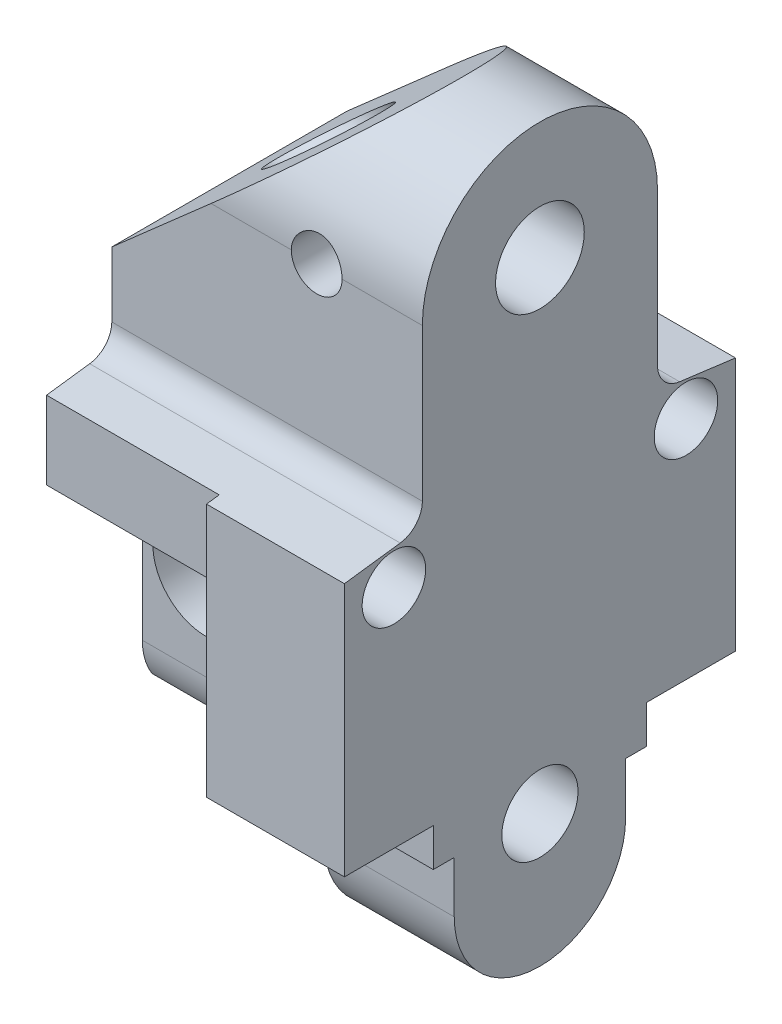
ISO-10303-21;
HEADER;
FILE_DESCRIPTION(('STEP AP214'),'2;1');
FILE_NAME('part.step','',(''),(''),'','','');
FILE_SCHEMA(('AUTOMOTIVE_DESIGN { 1 0 10303 214 1 1 1 1 }'));
ENDSEC;
DATA;
#1=APPLICATION_CONTEXT('core data for automotive mechanical design processes');
#2=APPLICATION_PROTOCOL_DEFINITION('international standard','automotive_design',2000,#1);
#3=PRODUCT_CONTEXT('',#1,'mechanical');
#4=PRODUCT('Part','Part','',(#3));
#5=PRODUCT_RELATED_PRODUCT_CATEGORY('part','',(#4));
#6=PRODUCT_DEFINITION_FORMATION('','',#4);
#7=PRODUCT_DEFINITION_CONTEXT('part definition',#1,'design');
#8=PRODUCT_DEFINITION('design','',#6,#7);
#9=PRODUCT_DEFINITION_SHAPE('','',#8);
#10=(LENGTH_UNIT() NAMED_UNIT(*) SI_UNIT(.MILLI.,.METRE.));
#11=(NAMED_UNIT(*) PLANE_ANGLE_UNIT() SI_UNIT($,.RADIAN.));
#12=(NAMED_UNIT(*) SI_UNIT($,.STERADIAN.) SOLID_ANGLE_UNIT());
#13=UNCERTAINTY_MEASURE_WITH_UNIT(LENGTH_MEASURE(1.E-05),#10,'distance_accuracy_value','');
#14=(GEOMETRIC_REPRESENTATION_CONTEXT(3) GLOBAL_UNCERTAINTY_ASSIGNED_CONTEXT((#13)) GLOBAL_UNIT_ASSIGNED_CONTEXT((#10,
#11,#12)) REPRESENTATION_CONTEXT('',''));
#15=CARTESIAN_POINT('',(0.,0.,0.));
#16=DIRECTION('',(0.,0.,1.));
#17=DIRECTION('',(1.,0.,0.));
#18=AXIS2_PLACEMENT_3D('',#15,#16,#17);
#19=CARTESIAN_POINT('',(-7.76605,30.6959,0.));
#20=DIRECTION('',(1.,0.,0.));
#21=DIRECTION('',(0.,0.,-1.));
#22=AXIS2_PLACEMENT_3D('',#19,#20,#21);
#23=PLANE('',#22);
#24=CARTESIAN_POINT('',(-7.76605,20.066,-7.3025));
#25=DIRECTION('',(1.,0.,0.));
#26=DIRECTION('',(0.,0.,-1.));
#27=AXIS2_PLACEMENT_3D('',#24,#25,#26);
#28=CIRCLE('',#27,1.5875);
#29=CARTESIAN_POINT('',(-7.76605,20.066,-8.89));
#30=VERTEX_POINT('',#29);
#31=EDGE_CURVE('E322',#30,#30,#28,.T.);
#32=ORIENTED_EDGE('',*,*,#31,.T.);
#33=EDGE_LOOP('',(#32));
#34=FACE_BOUND('',#33,.T.);
#35=CARTESIAN_POINT('',(-7.76605,20.066,7.3025));
#36=DIRECTION('',(1.,0.,0.));
#37=DIRECTION('',(0.,0.,-1.));
#38=AXIS2_PLACEMENT_3D('',#35,#36,#37);
#39=CIRCLE('',#38,1.5875);
#40=CARTESIAN_POINT('',(-7.76605,20.066,5.715));
#41=VERTEX_POINT('',#40);
#42=EDGE_CURVE('E317',#41,#41,#39,.T.);
#43=ORIENTED_EDGE('',*,*,#42,.T.);
#44=EDGE_LOOP('',(#43));
#45=FACE_BOUND('',#44,.T.);
#46=DIRECTION('',(0.,1.,0.));
#47=VECTOR('',#46,1.);
#48=CARTESIAN_POINT('',(-7.76605,30.6959,-9.144));
#49=LINE('',#48,#47);
#50=CARTESIAN_POINT('',(-7.76605,17.653,-9.144));
#51=VERTEX_POINT('',#50);
#52=CARTESIAN_POINT('',(-7.76605,21.5457361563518,-9.144));
#53=VERTEX_POINT('',#52);
#54=EDGE_CURVE('E711',#51,#53,#49,.T.);
#55=ORIENTED_EDGE('',*,*,#54,.F.);
#56=DIRECTION('',(0.,0.,1.));
#57=VECTOR('',#56,1.);
#58=CARTESIAN_POINT('',(-7.76605,17.653,0.));
#59=LINE('',#58,#57);
#60=CARTESIAN_POINT('',(-7.76605,17.653,-5.334));
#61=VERTEX_POINT('',#60);
#62=EDGE_CURVE('E572',#51,#61,#59,.T.);
#63=ORIENTED_EDGE('',*,*,#62,.T.);
#64=DIRECTION('',(0.,1.,0.));
#65=VECTOR('',#64,1.);
#66=CARTESIAN_POINT('',(-7.76605,0.,-5.334));
#67=LINE('',#66,#65);
#68=CARTESIAN_POINT('',(-7.76605,16.484599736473,-5.334));
#69=VERTEX_POINT('',#68);
#70=EDGE_CURVE('E567',#69,#61,#67,.T.);
#71=ORIENTED_EDGE('',*,*,#70,.F.);
#72=DIRECTION('',(0.,0.,-1.));
#73=VECTOR('',#72,1.);
#74=CARTESIAN_POINT('',(-7.76605,16.484599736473,0.));
#75=LINE('',#74,#73);
#76=CARTESIAN_POINT('',(-7.76605,16.484599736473,-4.10568024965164));
#77=VERTEX_POINT('',#76);
#78=EDGE_CURVE('E492',#77,#69,#75,.T.);
#79=ORIENTED_EDGE('',*,*,#78,.F.);
#80=DIRECTION('',(0.,1.,0.));
#81=VECTOR('',#80,1.);
#82=CARTESIAN_POINT('',(-7.76605,0.,-4.10568024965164));
#83=LINE('',#82,#81);
#84=CARTESIAN_POINT('',(-7.76605,8.53439973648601,-4.10568024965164));
#85=VERTEX_POINT('',#84);
#86=EDGE_CURVE('E489',#85,#77,#83,.T.);
#87=ORIENTED_EDGE('',*,*,#86,.F.);
#88=CARTESIAN_POINT('',(-7.76605,8.53439973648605,-0.930680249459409));
#89=DIRECTION('',(-1.,0.,0.));
#90=DIRECTION('',(0.,0.,1.));
#91=AXIS2_PLACEMENT_3D('',#88,#89,#90);
#92=CIRCLE('',#91,3.17500000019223);
#93=CARTESIAN_POINT('',(-7.76605,6.89028493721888,-3.64683774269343));
#94=VERTEX_POINT('',#93);
#95=EDGE_CURVE('E469',#85,#94,#92,.T.);
#96=ORIENTED_EDGE('',*,*,#95,.T.);
#97=CARTESIAN_POINT('',(-7.76605,6.37544177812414,0.));
#98=DIRECTION('',(-1.,0.,0.));
#99=DIRECTION('',(0.,0.,-1.));
#100=AXIS2_PLACEMENT_3D('',#97,#98,#99);
#101=CIRCLE('',#100,3.683);
#102=CARTESIAN_POINT('',(-7.76605,6.858,3.65125));
#103=VERTEX_POINT('',#102);
#104=EDGE_CURVE('E588',#103,#94,#101,.T.);
#105=ORIENTED_EDGE('',*,*,#104,.F.);
#106=DIRECTION('',(0.,0.,1.));
#107=VECTOR('',#106,1.);
#108=CARTESIAN_POINT('',(-7.76604999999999,6.858,-7.76605));
#109=LINE('',#108,#107);
#110=CARTESIAN_POINT('',(-7.76605,6.858,3.87321897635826));
#111=VERTEX_POINT('',#110);
#112=EDGE_CURVE('E607',#103,#111,#109,.T.);
#113=ORIENTED_EDGE('',*,*,#112,.T.);
#114=CARTESIAN_POINT('',(-7.76605,8.53398091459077,1.17710072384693));
#115=DIRECTION('',(-1.,0.,0.));
#116=DIRECTION('',(0.,0.,1.));
#117=AXIS2_PLACEMENT_3D('',#114,#115,#116);
#118=CIRCLE('',#117,3.17458117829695);
#119=CARTESIAN_POINT('',(-7.76605,8.53364634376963,4.35168188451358));
#120=VERTEX_POINT('',#119);
#121=EDGE_CURVE('E499',#111,#120,#118,.T.);
#122=ORIENTED_EDGE('',*,*,#121,.T.);
#123=DIRECTION('',(0.,-0.999999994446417,-0.000105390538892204));
#124=VECTOR('',#123,1.);
#125=CARTESIAN_POINT('',(-7.76605,-0.000458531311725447,4.35078247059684));
#126=LINE('',#125,#124);
#127=CARTESIAN_POINT('',(-7.76605,16.4845997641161,4.35251983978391));
#128=VERTEX_POINT('',#127);
#129=EDGE_CURVE('E496',#128,#120,#126,.T.);
#130=ORIENTED_EDGE('',*,*,#129,.F.);
#131=DIRECTION('',(0.,0.,-1.));
#132=VECTOR('',#131,1.);
#133=CARTESIAN_POINT('',(-7.76605,16.4845997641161,0.));
#134=LINE('',#133,#132);
#135=CARTESIAN_POINT('',(-7.76605,16.4845997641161,5.334));
#136=VERTEX_POINT('',#135);
#137=EDGE_CURVE('E494',#136,#128,#134,.T.);
#138=ORIENTED_EDGE('',*,*,#137,.F.);
#139=DIRECTION('',(0.,1.,0.));
#140=VECTOR('',#139,1.);
#141=CARTESIAN_POINT('',(-7.76605,0.,5.334));
#142=LINE('',#141,#140);
#143=CARTESIAN_POINT('',(-7.76605,17.653,5.334));
#144=VERTEX_POINT('',#143);
#145=EDGE_CURVE('E545',#136,#144,#142,.T.);
#146=ORIENTED_EDGE('',*,*,#145,.T.);
#147=DIRECTION('',(0.,0.,-1.));
#148=VECTOR('',#147,1.);
#149=CARTESIAN_POINT('',(-7.76605,17.653,0.));
#150=LINE('',#149,#148);
#151=CARTESIAN_POINT('',(-7.76605,17.653,9.144));
#152=VERTEX_POINT('',#151);
#153=EDGE_CURVE('E554',#152,#144,#150,.T.);
#154=ORIENTED_EDGE('',*,*,#153,.F.);
#155=DIRECTION('',(0.,-1.,0.));
#156=VECTOR('',#155,1.);
#157=CARTESIAN_POINT('',(-7.76605,30.6959,9.144));
#158=LINE('',#157,#156);
#159=CARTESIAN_POINT('',(-7.76605,21.5457361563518,9.144));
#160=VERTEX_POINT('',#159);
#161=EDGE_CURVE('E467',#160,#152,#158,.T.);
#162=ORIENTED_EDGE('',*,*,#161,.F.);
#163=DIRECTION('',(0.,-0.12920109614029,0.991618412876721));
#164=VECTOR('',#163,1.);
#165=CARTESIAN_POINT('',(-7.76605,21.463,9.779));
#166=LINE('',#165,#164);
#167=CARTESIAN_POINT('',(-7.76605,21.8269068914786,6.98601460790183));
#168=VERTEX_POINT('',#167);
#169=EDGE_CURVE('E463',#168,#160,#166,.T.);
#170=ORIENTED_EDGE('',*,*,#169,.F.);
#171=CARTESIAN_POINT('',(-7.76605,23.086262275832,7.1501));
#172=DIRECTION('',(1.,0.,0.));
#173=DIRECTION('',(0.,0.,-1.));
#174=AXIS2_PLACEMENT_3D('',#171,#172,#173);
#175=CIRCLE('',#174,1.27);
#176=CARTESIAN_POINT('',(-7.76605,23.086262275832,5.8801));
#177=VERTEX_POINT('',#176);
#178=EDGE_CURVE('E335',#168,#177,#175,.T.);
#179=ORIENTED_EDGE('',*,*,#178,.T.);
#180=DIRECTION('',(0.,-1.,0.));
#181=VECTOR('',#180,1.);
#182=CARTESIAN_POINT('',(-7.76605,30.6959,5.8801));
#183=LINE('',#182,#181);
#184=CARTESIAN_POINT('',(-7.76605,26.33345,5.8801));
#185=VERTEX_POINT('',#184);
#186=EDGE_CURVE('E659',#185,#177,#183,.T.);
#187=ORIENTED_EDGE('',*,*,#186,.F.);
#188=DIRECTION('',(0.,0.,1.));
#189=VECTOR('',#188,1.);
#190=CARTESIAN_POINT('',(-7.76605,26.33345,-7.76605));
#191=LINE('',#190,#189);
#192=CARTESIAN_POINT('',(-7.76605,26.33345,-5.8801));
#193=VERTEX_POINT('',#192);
#194=EDGE_CURVE('E316',#193,#185,#191,.T.);
#195=ORIENTED_EDGE('',*,*,#194,.F.);
#196=DIRECTION('',(0.,1.,0.));
#197=VECTOR('',#196,1.);
#198=CARTESIAN_POINT('',(-7.76605,30.6959,-5.8801));
#199=LINE('',#198,#197);
#200=CARTESIAN_POINT('',(-7.76605,23.086262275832,-5.8801));
#201=VERTEX_POINT('',#200);
#202=EDGE_CURVE('E657',#201,#193,#199,.T.);
#203=ORIENTED_EDGE('',*,*,#202,.F.);
#204=CARTESIAN_POINT('',(-7.76605,23.086262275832,-7.1501));
#205=DIRECTION('',(1.,0.,0.));
#206=DIRECTION('',(0.,0.,-1.));
#207=AXIS2_PLACEMENT_3D('',#204,#205,#206);
#208=CIRCLE('',#207,1.27);
#209=CARTESIAN_POINT('',(-7.76605,21.8269068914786,-6.98601460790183));
#210=VERTEX_POINT('',#209);
#211=EDGE_CURVE('E339',#201,#210,#208,.T.);
#212=ORIENTED_EDGE('',*,*,#211,.T.);
#213=DIRECTION('',(0.,0.12920109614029,0.991618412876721));
#214=VECTOR('',#213,1.);
#215=CARTESIAN_POINT('',(-7.76605,21.463,-9.779));
#216=LINE('',#215,#214);
#217=EDGE_CURVE('E628',#53,#210,#216,.T.);
#218=ORIENTED_EDGE('',*,*,#217,.F.);
#219=EDGE_LOOP('',(#55,#63,#71,#79,#87,#96,#105,#113,#122,#130,#138,#146,#154,#162,#170,#179,
#187,#195,#203,#212,#218));
#220=FACE_BOUND('',#219,.T.);
#221=ADVANCED_FACE('F32',(#34,#45,#220),#23,.F.);
#222=CARTESIAN_POINT('',(7.76605,8.763,-9.779));
#223=DIRECTION('',(0.,0.,1.));
#224=DIRECTION('',(1.,0.,0.));
#225=AXIS2_PLACEMENT_3D('',#222,#223,#224);
#226=PLANE('',#225);
#227=DIRECTION('',(0.,1.,0.));
#228=VECTOR('',#227,1.);
#229=CARTESIAN_POINT('',(0.86995,0.,-9.779));
#230=LINE('',#229,#228);
#231=CARTESIAN_POINT('',(0.86995,8.763,-9.779));
#232=VERTEX_POINT('',#231);
#233=CARTESIAN_POINT('',(0.869950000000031,21.463,-9.779));
#234=VERTEX_POINT('',#233);
#235=EDGE_CURVE('E577',#232,#234,#230,.T.);
#236=ORIENTED_EDGE('',*,*,#235,.T.);
#237=DIRECTION('',(-1.,0.,0.));
#238=VECTOR('',#237,1.);
#239=CARTESIAN_POINT('',(7.76605,21.463,-9.779));
#240=LINE('',#239,#238);
#241=CARTESIAN_POINT('',(7.76605,21.463,-9.779));
#242=VERTEX_POINT('',#241);
#243=EDGE_CURVE('E302',#242,#234,#240,.T.);
#244=ORIENTED_EDGE('',*,*,#243,.F.);
#245=DIRECTION('',(0.,1.,0.));
#246=VECTOR('',#245,1.);
#247=CARTESIAN_POINT('',(7.76605,8.763,-9.779));
#248=LINE('',#247,#246);
#249=CARTESIAN_POINT('',(7.76605,8.763,-9.779));
#250=VERTEX_POINT('',#249);
#251=EDGE_CURVE('E634',#250,#242,#248,.T.);
#252=ORIENTED_EDGE('',*,*,#251,.F.);
#253=DIRECTION('',(-1.,0.,0.));
#254=VECTOR('',#253,1.);
#255=CARTESIAN_POINT('',(7.76605,8.763,-9.779));
#256=LINE('',#255,#254);
#257=EDGE_CURVE('E305',#250,#232,#256,.T.);
#258=ORIENTED_EDGE('',*,*,#257,.T.);
#259=EDGE_LOOP('',(#236,#244,#252,#258));
#260=FACE_BOUND('',#259,.T.);
#261=ADVANCED_FACE('F400',(#260),#226,.F.);
#262=CARTESIAN_POINT('',(7.76605,21.463,-9.779));
#263=DIRECTION('',(0.,-0.991618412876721,0.12920109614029));
#264=DIRECTION('',(0.,-0.12920109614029,-0.991618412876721));
#265=AXIS2_PLACEMENT_3D('',#262,#263,#264);
#266=PLANE('',#265);
#267=DIRECTION('',(0.,-0.12920109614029,-0.991618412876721));
#268=VECTOR('',#267,1.);
#269=CARTESIAN_POINT('',(0.869950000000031,21.463,-9.779));
#270=LINE('',#269,#268);
#271=CARTESIAN_POINT('',(0.869950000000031,21.5457361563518,-9.144));
#272=VERTEX_POINT('',#271);
#273=EDGE_CURVE('E704',#272,#234,#270,.T.);
#274=ORIENTED_EDGE('',*,*,#273,.F.);
#275=DIRECTION('',(1.,0.,0.));
#276=VECTOR('',#275,1.);
#277=CARTESIAN_POINT('',(7.76605,21.5457361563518,-9.144));
#278=LINE('',#277,#276);
#279=EDGE_CURVE('E705',#53,#272,#278,.T.);
#280=ORIENTED_EDGE('',*,*,#279,.F.);
#281=ORIENTED_EDGE('',*,*,#217,.T.);
#282=DIRECTION('',(-1.,0.,0.));
#283=VECTOR('',#282,1.);
#284=CARTESIAN_POINT('',(7.76605,21.8269068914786,-6.98601460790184));
#285=LINE('',#284,#283);
#286=CARTESIAN_POINT('',(7.76605,21.8269068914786,-6.98601460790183));
#287=VERTEX_POINT('',#286);
#288=EDGE_CURVE('E333',#210,#287,#285,.F.);
#289=ORIENTED_EDGE('',*,*,#288,.T.);
#290=DIRECTION('',(0.,0.12920109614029,0.991618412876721));
#291=VECTOR('',#290,1.);
#292=CARTESIAN_POINT('',(7.76605,21.463,-9.779));
#293=LINE('',#292,#291);
#294=EDGE_CURVE('E636',#242,#287,#293,.T.);
#295=ORIENTED_EDGE('',*,*,#294,.F.);
#296=ORIENTED_EDGE('',*,*,#243,.T.);
#297=EDGE_LOOP('',(#274,#280,#281,#289,#295,#296));
#298=FACE_BOUND('',#297,.T.);
#299=ADVANCED_FACE('F396',(#298),#266,.F.);
#300=CARTESIAN_POINT('',(0.86995,17.653,0.));
#301=DIRECTION('',(0.,-1.,0.));
#302=DIRECTION('',(0.,0.,-1.));
#303=AXIS2_PLACEMENT_3D('',#300,#301,#302);
#304=PLANE('',#303);
#305=ORIENTED_EDGE('',*,*,#62,.F.);
#306=DIRECTION('',(1.,0.,0.));
#307=VECTOR('',#306,1.);
#308=CARTESIAN_POINT('',(0.86995,17.653,-9.144));
#309=LINE('',#308,#307);
#310=CARTESIAN_POINT('',(0.86995,17.653,-9.144));
#311=VERTEX_POINT('',#310);
#312=EDGE_CURVE('E913',#51,#311,#309,.T.);
#313=ORIENTED_EDGE('',*,*,#312,.T.);
#314=DIRECTION('',(0.,0.,1.));
#315=VECTOR('',#314,1.);
#316=CARTESIAN_POINT('',(0.86995,17.653,0.));
#317=LINE('',#316,#315);
#318=CARTESIAN_POINT('',(0.86995,17.653,-5.334));
#319=VERTEX_POINT('',#318);
#320=EDGE_CURVE('E575',#311,#319,#317,.T.);
#321=ORIENTED_EDGE('',*,*,#320,.T.);
#322=DIRECTION('',(-1.,0.,0.));
#323=VECTOR('',#322,1.);
#324=CARTESIAN_POINT('',(0.86995,17.653,-5.334));
#325=LINE('',#324,#323);
#326=EDGE_CURVE('E325',#319,#61,#325,.T.);
#327=ORIENTED_EDGE('',*,*,#326,.T.);
#328=EDGE_LOOP('',(#305,#313,#321,#327));
#329=FACE_BOUND('',#328,.T.);
#330=ADVANCED_FACE('F399',(#329),#304,.T.);
#331=CARTESIAN_POINT('',(0.86995,17.653,0.));
#332=DIRECTION('',(0.,1.,0.));
#333=DIRECTION('',(0.,0.,1.));
#334=AXIS2_PLACEMENT_3D('',#331,#332,#333);
#335=PLANE('',#334);
#336=DIRECTION('',(1.,0.,0.));
#337=VECTOR('',#336,1.);
#338=CARTESIAN_POINT('',(0.86995,17.653,9.144));
#339=LINE('',#338,#337);
#340=CARTESIAN_POINT('',(0.869950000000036,17.653,9.144));
#341=VERTEX_POINT('',#340);
#342=EDGE_CURVE('E471',#152,#341,#339,.T.);
#343=ORIENTED_EDGE('',*,*,#342,.F.);
#344=ORIENTED_EDGE('',*,*,#153,.T.);
#345=DIRECTION('',(-1.,0.,0.));
#346=VECTOR('',#345,1.);
#347=CARTESIAN_POINT('',(0.86995,17.653,5.334));
#348=LINE('',#347,#346);
#349=CARTESIAN_POINT('',(0.86995,17.653,5.334));
#350=VERTEX_POINT('',#349);
#351=EDGE_CURVE('E561',#350,#144,#348,.T.);
#352=ORIENTED_EDGE('',*,*,#351,.F.);
#353=DIRECTION('',(0.,0.,-1.));
#354=VECTOR('',#353,1.);
#355=CARTESIAN_POINT('',(0.86995,17.653,0.));
#356=LINE('',#355,#354);
#357=EDGE_CURVE('E559',#341,#350,#356,.T.);
#358=ORIENTED_EDGE('',*,*,#357,.F.);
#359=EDGE_LOOP('',(#343,#344,#352,#358));
#360=FACE_BOUND('',#359,.T.);
#361=ADVANCED_FACE('F724',(#360),#335,.F.);
#362=CARTESIAN_POINT('',(-7.76604999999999,6.858,-7.76605));
#363=DIRECTION('',(0.,1.,0.));
#364=DIRECTION('',(0.,0.,1.));
#365=AXIS2_PLACEMENT_3D('',#362,#363,#364);
#366=PLANE('',#365);
#367=DIRECTION('',(0.,0.,1.));
#368=VECTOR('',#367,1.);
#369=CARTESIAN_POINT('',(0.86995,6.858,-7.76605));
#370=LINE('',#369,#368);
#371=CARTESIAN_POINT('',(0.86995,6.858,-5.334));
#372=VERTEX_POINT('',#371);
#373=CARTESIAN_POINT('',(0.86995,6.858,-3.65125));
#374=VERTEX_POINT('',#373);
#375=EDGE_CURVE('E517',#372,#374,#370,.T.);
#376=ORIENTED_EDGE('',*,*,#375,.F.);
#377=DIRECTION('',(-1.,0.,0.));
#378=VECTOR('',#377,1.);
#379=CARTESIAN_POINT('',(9.94017167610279,6.858,-5.334));
#380=LINE('',#379,#378);
#381=CARTESIAN_POINT('',(7.76605,6.858,-5.334));
#382=VERTEX_POINT('',#381);
#383=EDGE_CURVE('E527',#382,#372,#380,.T.);
#384=ORIENTED_EDGE('',*,*,#383,.F.);
#385=DIRECTION('',(0.,0.,1.));
#386=VECTOR('',#385,1.);
#387=CARTESIAN_POINT('',(7.76605,6.858,0.));
#388=LINE('',#387,#386);
#389=CARTESIAN_POINT('',(7.76605,6.858,-4.28625));
#390=VERTEX_POINT('',#389);
#391=EDGE_CURVE('E524',#382,#390,#388,.T.);
#392=ORIENTED_EDGE('',*,*,#391,.T.);
#393=DIRECTION('',(-1.,0.,0.));
#394=VECTOR('',#393,1.);
#395=CARTESIAN_POINT('',(9.94017167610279,6.858,-4.28625));
#396=LINE('',#395,#394);
#397=CARTESIAN_POINT('',(1.26365000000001,6.858,-4.28625));
#398=VERTEX_POINT('',#397);
#399=EDGE_CURVE('E528',#390,#398,#396,.T.);
#400=ORIENTED_EDGE('',*,*,#399,.T.);
#401=DIRECTION('',(0.,0.,1.));
#402=VECTOR('',#401,1.);
#403=CARTESIAN_POINT('',(1.26365000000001,6.858,-7.76605));
#404=LINE('',#403,#402);
#405=CARTESIAN_POINT('',(1.26365000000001,6.858,-3.65125));
#406=VERTEX_POINT('',#405);
#407=EDGE_CURVE('E611',#398,#406,#404,.T.);
#408=ORIENTED_EDGE('',*,*,#407,.T.);
#409=DIRECTION('',(-1.,0.,0.));
#410=VECTOR('',#409,1.);
#411=CARTESIAN_POINT('',(10.7723296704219,6.858,-3.65125));
#412=LINE('',#411,#410);
#413=EDGE_CURVE('E594',#406,#374,#412,.T.);
#414=ORIENTED_EDGE('',*,*,#413,.T.);
#415=EDGE_LOOP('',(#376,#384,#392,#400,#408,#414));
#416=FACE_BOUND('',#415,.T.);
#417=ADVANCED_FACE('F766',(#416),#366,.F.);
#418=DIRECTION('',(-1.,0.,0.));
#419=VECTOR('',#418,1.);
#420=CARTESIAN_POINT('',(51.4669795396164,6.858,3.87321897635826));
#421=LINE('',#420,#419);
#422=CARTESIAN_POINT('',(0.869950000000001,6.858,3.87321897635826));
#423=VERTEX_POINT('',#422);
#424=EDGE_CURVE('E11',#111,#423,#421,.F.);
#425=ORIENTED_EDGE('',*,*,#424,.F.);
#426=ORIENTED_EDGE('',*,*,#112,.F.);
#427=DIRECTION('',(-1.,0.,0.));
#428=VECTOR('',#427,1.);
#429=CARTESIAN_POINT('',(10.7723296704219,6.858,3.65125));
#430=LINE('',#429,#428);
#431=CARTESIAN_POINT('',(1.26365000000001,6.858,3.65125));
#432=VERTEX_POINT('',#431);
#433=EDGE_CURVE('E591',#432,#103,#430,.T.);
#434=ORIENTED_EDGE('',*,*,#433,.F.);
#435=CARTESIAN_POINT('',(1.26365000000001,6.858,4.28625));
#436=VERTEX_POINT('',#435);
#437=EDGE_CURVE('E606',#432,#436,#404,.T.);
#438=ORIENTED_EDGE('',*,*,#437,.T.);
#439=DIRECTION('',(-1.,0.,0.));
#440=VECTOR('',#439,1.);
#441=CARTESIAN_POINT('',(9.94017167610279,6.858,4.28625));
#442=LINE('',#441,#440);
#443=CARTESIAN_POINT('',(7.76605,6.858,4.28625));
#444=VERTEX_POINT('',#443);
#445=EDGE_CURVE('E541',#444,#436,#442,.T.);
#446=ORIENTED_EDGE('',*,*,#445,.F.);
#447=DIRECTION('',(0.,0.,-1.));
#448=VECTOR('',#447,1.);
#449=CARTESIAN_POINT('',(7.76605,6.858,0.));
#450=LINE('',#449,#448);
#451=CARTESIAN_POINT('',(7.76605,6.858,5.334));
#452=VERTEX_POINT('',#451);
#453=EDGE_CURVE('E538',#452,#444,#450,.T.);
#454=ORIENTED_EDGE('',*,*,#453,.F.);
#455=DIRECTION('',(-1.,0.,0.));
#456=VECTOR('',#455,1.);
#457=CARTESIAN_POINT('',(9.94017167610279,6.858,5.334));
#458=LINE('',#457,#456);
#459=CARTESIAN_POINT('',(0.86995,6.858,5.334));
#460=VERTEX_POINT('',#459);
#461=EDGE_CURVE('E546',#452,#460,#458,.T.);
#462=ORIENTED_EDGE('',*,*,#461,.T.);
#463=DIRECTION('',(0.,0.,1.));
#464=VECTOR('',#463,1.);
#465=CARTESIAN_POINT('',(0.86995,6.858,-7.76605));
#466=LINE('',#465,#464);
#467=EDGE_CURVE('E513',#423,#460,#466,.T.);
#468=ORIENTED_EDGE('',*,*,#467,.F.);
#469=EDGE_LOOP('',(#425,#426,#434,#438,#446,#454,#462,#468));
#470=FACE_BOUND('',#469,.T.);
#471=ADVANCED_FACE('F747',(#470),#366,.F.);
#472=CARTESIAN_POINT('',(10.7723296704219,6.37544177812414,0.));
#473=DIRECTION('',(-1.,0.,0.));
#474=DIRECTION('',(0.,0.,1.));
#475=AXIS2_PLACEMENT_3D('',#472,#473,#474);
#476=CYLINDRICAL_SURFACE('',#475,3.683);
#477=DIRECTION('',(-1.,0.,0.));
#478=VECTOR('',#477,1.);
#479=CARTESIAN_POINT('',(-3.44804999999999,6.89028493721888,-3.64683774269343));
#480=LINE('',#479,#478);
#481=CARTESIAN_POINT('',(0.869950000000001,6.89028493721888,-3.64683774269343));
#482=VERTEX_POINT('',#481);
#483=EDGE_CURVE('E46',#482,#94,#480,.T.);
#484=ORIENTED_EDGE('',*,*,#483,.F.);
#485=CARTESIAN_POINT('',(0.86995,6.37544177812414,0.));
#486=DIRECTION('',(-1.,0.,0.));
#487=DIRECTION('',(0.,0.,1.));
#488=AXIS2_PLACEMENT_3D('',#485,#486,#487);
#489=CIRCLE('',#488,3.683);
#490=EDGE_CURVE('E519',#374,#482,#489,.F.);
#491=ORIENTED_EDGE('',*,*,#490,.F.);
#492=ORIENTED_EDGE('',*,*,#413,.F.);
#493=CARTESIAN_POINT('',(1.26365000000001,6.37544177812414,0.));
#494=DIRECTION('',(1.,0.,0.));
#495=DIRECTION('',(0.,0.,-1.));
#496=AXIS2_PLACEMENT_3D('',#493,#494,#495);
#497=CIRCLE('',#496,3.683);
#498=EDGE_CURVE('E592',#432,#406,#497,.F.);
#499=ORIENTED_EDGE('',*,*,#498,.F.);
#500=ORIENTED_EDGE('',*,*,#433,.T.);
#501=ORIENTED_EDGE('',*,*,#104,.T.);
#502=EDGE_LOOP('',(#484,#491,#492,#499,#500,#501));
#503=FACE_BOUND('',#502,.T.);
#504=ADVANCED_FACE('F774',(#503),#476,.F.);
#505=CARTESIAN_POINT('',(0.86995,0.,-5.334));
#506=DIRECTION('',(0.,0.,1.));
#507=DIRECTION('',(1.,0.,0.));
#508=AXIS2_PLACEMENT_3D('',#505,#506,#507);
#509=PLANE('',#508);
#510=DIRECTION('',(0.,-1.,0.));
#511=VECTOR('',#510,1.);
#512=CARTESIAN_POINT('',(0.86995,0.,-5.334));
#513=LINE('',#512,#511);
#514=CARTESIAN_POINT('',(0.86995,8.763,-5.334));
#515=VERTEX_POINT('',#514);
#516=EDGE_CURVE('E515',#515,#372,#513,.T.);
#517=ORIENTED_EDGE('',*,*,#516,.F.);
#518=DIRECTION('',(-1.,0.,0.));
#519=VECTOR('',#518,1.);
#520=CARTESIAN_POINT('',(9.94017167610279,8.763,-5.334));
#521=LINE('',#520,#519);
#522=CARTESIAN_POINT('',(7.76605,8.763,-5.334));
#523=VERTEX_POINT('',#522);
#524=EDGE_CURVE('E533',#523,#515,#521,.T.);
#525=ORIENTED_EDGE('',*,*,#524,.F.);
#526=DIRECTION('',(0.,-1.,0.));
#527=VECTOR('',#526,1.);
#528=CARTESIAN_POINT('',(7.76605,0.,-5.334));
#529=LINE('',#528,#527);
#530=EDGE_CURVE('E525',#523,#382,#529,.T.);
#531=ORIENTED_EDGE('',*,*,#530,.T.);
#532=ORIENTED_EDGE('',*,*,#383,.T.);
#533=EDGE_LOOP('',(#517,#525,#531,#532));
#534=FACE_BOUND('',#533,.T.);
#535=ADVANCED_FACE('F776',(#534),#509,.F.);
#536=CARTESIAN_POINT('',(0.86995,0.,5.334));
#537=DIRECTION('',(0.,0.,1.));
#538=DIRECTION('',(1.,0.,0.));
#539=AXIS2_PLACEMENT_3D('',#536,#537,#538);
#540=PLANE('',#539);
#541=DIRECTION('',(-1.,0.,0.));
#542=VECTOR('',#541,1.);
#543=CARTESIAN_POINT('',(9.94017167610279,8.763,5.334));
#544=LINE('',#543,#542);
#545=CARTESIAN_POINT('',(7.76605,8.763,5.334));
#546=VERTEX_POINT('',#545);
#547=CARTESIAN_POINT('',(0.86995,8.763,5.334));
#548=VERTEX_POINT('',#547);
#549=EDGE_CURVE('E542',#546,#548,#544,.T.);
#550=ORIENTED_EDGE('',*,*,#549,.T.);
#551=DIRECTION('',(0.,-1.,0.));
#552=VECTOR('',#551,1.);
#553=CARTESIAN_POINT('',(0.86995,0.,5.334));
#554=LINE('',#553,#552);
#555=EDGE_CURVE('E344',#548,#460,#554,.T.);
#556=ORIENTED_EDGE('',*,*,#555,.T.);
#557=ORIENTED_EDGE('',*,*,#461,.F.);
#558=DIRECTION('',(0.,-1.,0.));
#559=VECTOR('',#558,1.);
#560=CARTESIAN_POINT('',(7.76605,0.,5.334));
#561=LINE('',#560,#559);
#562=EDGE_CURVE('E536',#546,#452,#561,.T.);
#563=ORIENTED_EDGE('',*,*,#562,.F.);
#564=EDGE_LOOP('',(#550,#556,#557,#563));
#565=FACE_BOUND('',#564,.T.);
#566=ADVANCED_FACE('F445',(#565),#540,.T.);
#567=CARTESIAN_POINT('',(7.76605,8.763,9.779));
#568=DIRECTION('',(0.,1.,0.));
#569=DIRECTION('',(0.,0.,1.));
#570=AXIS2_PLACEMENT_3D('',#567,#568,#569);
#571=PLANE('',#570);
#572=ORIENTED_EDGE('',*,*,#549,.F.);
#573=DIRECTION('',(0.,0.,-1.));
#574=VECTOR('',#573,1.);
#575=CARTESIAN_POINT('',(7.76605,8.763,9.779));
#576=LINE('',#575,#574);
#577=CARTESIAN_POINT('',(7.76605,8.763,9.779));
#578=VERTEX_POINT('',#577);
#579=EDGE_CURVE('E648',#578,#546,#576,.T.);
#580=ORIENTED_EDGE('',*,*,#579,.F.);
#581=DIRECTION('',(-1.,0.,0.));
#582=VECTOR('',#581,1.);
#583=CARTESIAN_POINT('',(7.76605,8.763,9.779));
#584=LINE('',#583,#582);
#585=CARTESIAN_POINT('',(0.86995,8.763,9.779));
#586=VERTEX_POINT('',#585);
#587=EDGE_CURVE('E667',#578,#586,#584,.T.);
#588=ORIENTED_EDGE('',*,*,#587,.T.);
#589=DIRECTION('',(0.,0.,-1.));
#590=VECTOR('',#589,1.);
#591=CARTESIAN_POINT('',(0.86995,8.763,0.));
#592=LINE('',#591,#590);
#593=EDGE_CURVE('E553',#586,#548,#592,.T.);
#594=ORIENTED_EDGE('',*,*,#593,.T.);
#595=EDGE_LOOP('',(#572,#580,#588,#594));
#596=FACE_BOUND('',#595,.T.);
#597=ADVANCED_FACE('F441',(#596),#571,.F.);
#598=CARTESIAN_POINT('',(7.76605,4.28625,4.28625));
#599=DIRECTION('',(0.,0.,-1.));
#600=DIRECTION('',(-1.,0.,0.));
#601=AXIS2_PLACEMENT_3D('',#598,#599,#600);
#602=PLANE('',#601);
#603=ORIENTED_EDGE('',*,*,#445,.T.);
#604=DIRECTION('',(0.,-1.,0.));
#605=VECTOR('',#604,1.);
#606=CARTESIAN_POINT('',(1.26365000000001,4.28625,4.28625));
#607=LINE('',#606,#605);
#608=CARTESIAN_POINT('',(1.26365000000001,4.28625,4.28625));
#609=VERTEX_POINT('',#608);
#610=EDGE_CURVE('E616',#436,#609,#607,.T.);
#611=ORIENTED_EDGE('',*,*,#610,.T.);
#612=DIRECTION('',(-1.,0.,0.));
#613=VECTOR('',#612,1.);
#614=CARTESIAN_POINT('',(7.76605,4.28625,4.28625));
#615=LINE('',#614,#613);
#616=CARTESIAN_POINT('',(7.76605,4.28625,4.28625));
#617=VERTEX_POINT('',#616);
#618=EDGE_CURVE('E665',#617,#609,#615,.T.);
#619=ORIENTED_EDGE('',*,*,#618,.F.);
#620=DIRECTION('',(0.,-1.,0.));
#621=VECTOR('',#620,1.);
#622=CARTESIAN_POINT('',(7.76605,4.28625,4.28625));
#623=LINE('',#622,#621);
#624=EDGE_CURVE('E651',#444,#617,#623,.T.);
#625=ORIENTED_EDGE('',*,*,#624,.F.);
#626=EDGE_LOOP('',(#603,#611,#619,#625));
#627=FACE_BOUND('',#626,.T.);
#628=ADVANCED_FACE('F438',(#627),#602,.F.);
#629=CARTESIAN_POINT('',(7.76605,30.6959,0.));
#630=DIRECTION('',(1.,0.,0.));
#631=DIRECTION('',(0.,0.,-1.));
#632=AXIS2_PLACEMENT_3D('',#629,#630,#631);
#633=PLANE('',#632);
#634=DIRECTION('',(0.,1.,0.));
#635=VECTOR('',#634,1.);
#636=CARTESIAN_POINT('',(7.76605,4.28625,-4.28625));
#637=LINE('',#636,#635);
#638=CARTESIAN_POINT('',(7.76605,4.28625,-4.28625));
#639=VERTEX_POINT('',#638);
#640=EDGE_CURVE('E629',#639,#390,#637,.T.);
#641=ORIENTED_EDGE('',*,*,#640,.T.);
#642=ORIENTED_EDGE('',*,*,#391,.F.);
#643=ORIENTED_EDGE('',*,*,#530,.F.);
#644=DIRECTION('',(0.,0.,-1.));
#645=VECTOR('',#644,1.);
#646=CARTESIAN_POINT('',(7.76605,8.763,-4.28625));
#647=LINE('',#646,#645);
#648=EDGE_CURVE('E632',#523,#250,#647,.T.);
#649=ORIENTED_EDGE('',*,*,#648,.T.);
#650=ORIENTED_EDGE('',*,*,#251,.T.);
#651=ORIENTED_EDGE('',*,*,#294,.T.);
#652=CARTESIAN_POINT('',(7.76605,23.086262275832,-7.1501));
#653=DIRECTION('',(1.,0.,0.));
#654=DIRECTION('',(0.,0.,-1.));
#655=AXIS2_PLACEMENT_3D('',#652,#653,#654);
#656=CIRCLE('',#655,1.27);
#657=CARTESIAN_POINT('',(7.76605,23.086262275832,-5.8801));
#658=VERTEX_POINT('',#657);
#659=EDGE_CURVE('E342',#287,#658,#656,.F.);
#660=ORIENTED_EDGE('',*,*,#659,.T.);
#661=DIRECTION('',(0.,1.,0.));
#662=VECTOR('',#661,1.);
#663=CARTESIAN_POINT('',(7.76605,30.6959,-5.8801));
#664=LINE('',#663,#662);
#665=CARTESIAN_POINT('',(7.76605,30.6959,-5.8801));
#666=VERTEX_POINT('',#665);
#667=EDGE_CURVE('E639',#658,#666,#664,.T.);
#668=ORIENTED_EDGE('',*,*,#667,.T.);
#669=CARTESIAN_POINT('',(7.76605,30.6959,0.));
#670=DIRECTION('',(1.,0.,0.));
#671=DIRECTION('',(0.,0.,-1.));
#672=AXIS2_PLACEMENT_3D('',#669,#670,#671);
#673=CIRCLE('',#672,5.8801);
#674=CARTESIAN_POINT('',(7.76605,30.6959,5.8801));
#675=VERTEX_POINT('',#674);
#676=EDGE_CURVE('E641',#666,#675,#673,.T.);
#677=ORIENTED_EDGE('',*,*,#676,.T.);
#678=DIRECTION('',(0.,-1.,0.));
#679=VECTOR('',#678,1.);
#680=CARTESIAN_POINT('',(7.76605,30.6959,5.8801));
#681=LINE('',#680,#679);
#682=CARTESIAN_POINT('',(7.76605,23.086262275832,5.8801));
#683=VERTEX_POINT('',#682);
#684=EDGE_CURVE('E293',#675,#683,#681,.T.);
#685=ORIENTED_EDGE('',*,*,#684,.T.);
#686=CARTESIAN_POINT('',(7.76605,23.086262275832,7.1501));
#687=DIRECTION('',(1.,0.,0.));
#688=DIRECTION('',(0.,0.,-1.));
#689=AXIS2_PLACEMENT_3D('',#686,#687,#688);
#690=CIRCLE('',#689,1.27);
#691=CARTESIAN_POINT('',(7.76605,21.8269068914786,6.98601460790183));
#692=VERTEX_POINT('',#691);
#693=EDGE_CURVE('E337',#683,#692,#690,.F.);
#694=ORIENTED_EDGE('',*,*,#693,.T.);
#695=DIRECTION('',(0.,-0.12920109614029,0.991618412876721));
#696=VECTOR('',#695,1.);
#697=CARTESIAN_POINT('',(7.76605,21.463,9.779));
#698=LINE('',#697,#696);
#699=CARTESIAN_POINT('',(7.76605,21.463,9.779));
#700=VERTEX_POINT('',#699);
#701=EDGE_CURVE('E644',#692,#700,#698,.T.);
#702=ORIENTED_EDGE('',*,*,#701,.T.);
#703=DIRECTION('',(0.,-1.,0.));
#704=VECTOR('',#703,1.);
#705=CARTESIAN_POINT('',(7.76605,8.763,9.779));
#706=LINE('',#705,#704);
#707=EDGE_CURVE('E646',#700,#578,#706,.T.);
#708=ORIENTED_EDGE('',*,*,#707,.T.);
#709=ORIENTED_EDGE('',*,*,#579,.T.);
#710=ORIENTED_EDGE('',*,*,#562,.T.);
#711=ORIENTED_EDGE('',*,*,#453,.T.);
#712=ORIENTED_EDGE('',*,*,#624,.T.);
#713=CARTESIAN_POINT('',(7.76605,4.28625,0.));
#714=DIRECTION('',(1.,0.,0.));
#715=DIRECTION('',(0.,0.,-1.));
#716=AXIS2_PLACEMENT_3D('',#713,#714,#715);
#717=CIRCLE('',#716,4.28625);
#718=EDGE_CURVE('E653',#617,#639,#717,.T.);
#719=ORIENTED_EDGE('',*,*,#718,.T.);
#720=EDGE_LOOP('',(#641,#642,#643,#649,#650,#651,#660,#668,#677,#685,#694,#702,#708,#709,#710,
#711,#712,#719));
#721=FACE_BOUND('',#720,.T.);
#722=CARTESIAN_POINT('',(7.76605,20.066,-7.3025));
#723=DIRECTION('',(1.,0.,0.));
#724=DIRECTION('',(0.,0.,-1.));
#725=AXIS2_PLACEMENT_3D('',#722,#723,#724);
#726=CIRCLE('',#725,1.5875);
#727=CARTESIAN_POINT('',(7.76605,20.066,-8.89));
#728=VERTEX_POINT('',#727);
#729=EDGE_CURVE('E321',#728,#728,#726,.T.);
#730=ORIENTED_EDGE('',*,*,#729,.F.);
#731=EDGE_LOOP('',(#730));
#732=FACE_BOUND('',#731,.T.);
#733=CARTESIAN_POINT('',(7.76605,20.066,7.3025));
#734=DIRECTION('',(1.,0.,0.));
#735=DIRECTION('',(0.,0.,-1.));
#736=AXIS2_PLACEMENT_3D('',#733,#734,#735);
#737=CIRCLE('',#736,1.5875);
#738=CARTESIAN_POINT('',(7.76605,20.066,5.715));
#739=VERTEX_POINT('',#738);
#740=EDGE_CURVE('E320',#739,#739,#737,.T.);
#741=ORIENTED_EDGE('',*,*,#740,.F.);
#742=EDGE_LOOP('',(#741));
#743=FACE_BOUND('',#742,.T.);
#744=CARTESIAN_POINT('',(7.76605,30.6959,0.));
#745=DIRECTION('',(1.,0.,0.));
#746=DIRECTION('',(0.,0.,-1.));
#747=AXIS2_PLACEMENT_3D('',#744,#745,#746);
#748=CIRCLE('',#747,2.2178391);
#749=CARTESIAN_POINT('',(7.76605,30.6959,-2.2178391));
#750=VERTEX_POINT('',#749);
#751=EDGE_CURVE('E625',#750,#750,#748,.T.);
#752=ORIENTED_EDGE('',*,*,#751,.F.);
#753=EDGE_LOOP('',(#752));
#754=FACE_BOUND('',#753,.T.);
#755=CARTESIAN_POINT('',(7.76605,6.62305,0.));
#756=DIRECTION('',(1.,0.,0.));
#757=DIRECTION('',(0.,0.,-1.));
#758=AXIS2_PLACEMENT_3D('',#755,#756,#757);
#759=CIRCLE('',#758,1.905);
#760=CARTESIAN_POINT('',(7.76605,6.62305,1.905));
#761=VERTEX_POINT('',#760);
#762=EDGE_CURVE('E622',#761,#761,#759,.T.);
#763=ORIENTED_EDGE('',*,*,#762,.F.);
#764=EDGE_LOOP('',(#763));
#765=FACE_BOUND('',#764,.T.);
#766=ADVANCED_FACE('F410',(#721,#732,#743,#754,#765),#633,.T.);
#767=CARTESIAN_POINT('',(7.76605,4.28625,-4.28625));
#768=DIRECTION('',(0.,0.,1.));
#769=DIRECTION('',(1.,0.,0.));
#770=AXIS2_PLACEMENT_3D('',#767,#768,#769);
#771=PLANE('',#770);
#772=DIRECTION('',(0.,1.,0.));
#773=VECTOR('',#772,1.);
#774=CARTESIAN_POINT('',(1.26365000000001,4.28625,-4.28625));
#775=LINE('',#774,#773);
#776=CARTESIAN_POINT('',(1.26365000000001,4.28625,-4.28625));
#777=VERTEX_POINT('',#776);
#778=EDGE_CURVE('E619',#777,#398,#775,.T.);
#779=ORIENTED_EDGE('',*,*,#778,.T.);
#780=ORIENTED_EDGE('',*,*,#399,.F.);
#781=ORIENTED_EDGE('',*,*,#640,.F.);
#782=DIRECTION('',(-1.,0.,0.));
#783=VECTOR('',#782,1.);
#784=CARTESIAN_POINT('',(7.76605,4.28625,-4.28625));
#785=LINE('',#784,#783);
#786=EDGE_CURVE('E655',#639,#777,#785,.T.);
#787=ORIENTED_EDGE('',*,*,#786,.T.);
#788=EDGE_LOOP('',(#779,#780,#781,#787));
#789=FACE_BOUND('',#788,.T.);
#790=ADVANCED_FACE('F407',(#789),#771,.F.);
#791=CARTESIAN_POINT('',(7.76605,8.763,-4.28625));
#792=DIRECTION('',(0.,1.,0.));
#793=DIRECTION('',(0.,0.,1.));
#794=AXIS2_PLACEMENT_3D('',#791,#792,#793);
#795=PLANE('',#794);
#796=ORIENTED_EDGE('',*,*,#648,.F.);
#797=ORIENTED_EDGE('',*,*,#524,.T.);
#798=DIRECTION('',(0.,0.,1.));
#799=VECTOR('',#798,1.);
#800=CARTESIAN_POINT('',(0.86995,8.763,0.));
#801=LINE('',#800,#799);
#802=EDGE_CURVE('E568',#232,#515,#801,.T.);
#803=ORIENTED_EDGE('',*,*,#802,.F.);
#804=ORIENTED_EDGE('',*,*,#257,.F.);
#805=EDGE_LOOP('',(#796,#797,#803,#804));
#806=FACE_BOUND('',#805,.T.);
#807=ADVANCED_FACE('F394',(#806),#795,.F.);
#808=CARTESIAN_POINT('',(7.76605,30.6959,-5.8801));
#809=DIRECTION('',(0.,0.,1.));
#810=DIRECTION('',(1.,0.,0.));
#811=AXIS2_PLACEMENT_3D('',#808,#809,#810);
#812=PLANE('',#811);
#813=DIRECTION('',(-1.,0.,0.));
#814=VECTOR('',#813,1.);
#815=CARTESIAN_POINT('',(7.76605,30.6959,-5.8801));
#816=LINE('',#815,#814);
#817=CARTESIAN_POINT('',(1.21075465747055,30.6959,-5.8801));
#818=VERTEX_POINT('',#817);
#819=CARTESIAN_POINT('',(-2.8045406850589,30.6959,-5.8801));
#820=VERTEX_POINT('',#819);
#821=EDGE_CURVE('E294',#818,#820,#816,.T.);
#822=ORIENTED_EDGE('',*,*,#821,.F.);
#823=CARTESIAN_POINT('',(2.48075465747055,30.6959,-5.8801));
#824=DIRECTION('',(0.,0.,1.));
#825=DIRECTION('',(1.,0.,0.));
#826=AXIS2_PLACEMENT_3D('',#823,#824,#825);
#827=CIRCLE('',#826,1.27);
#828=CARTESIAN_POINT('',(3.75075465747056,30.6959,-5.8801));
#829=VERTEX_POINT('',#828);
#830=EDGE_CURVE('E53',#818,#829,#827,.T.);
#831=ORIENTED_EDGE('',*,*,#830,.T.);
#832=EDGE_CURVE('E296',#666,#829,#816,.T.);
#833=ORIENTED_EDGE('',*,*,#832,.F.);
#834=ORIENTED_EDGE('',*,*,#667,.F.);
#835=DIRECTION('',(-1.,0.,0.));
#836=VECTOR('',#835,1.);
#837=CARTESIAN_POINT('',(-7.76605,23.086262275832,-5.8801));
#838=LINE('',#837,#836);
#839=EDGE_CURVE('E330',#658,#201,#838,.T.);
#840=ORIENTED_EDGE('',*,*,#839,.T.);
#841=ORIENTED_EDGE('',*,*,#202,.T.);
#842=DIRECTION('',(0.750989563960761,0.660314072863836,0.));
#843=VECTOR('',#842,1.);
#844=CARTESIAN_POINT('',(3.1571173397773,35.9377394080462,-5.8801));
#845=LINE('',#844,#843);
#846=EDGE_CURVE('E603',#193,#820,#845,.T.);
#847=ORIENTED_EDGE('',*,*,#846,.T.);
#848=EDGE_LOOP('',(#822,#831,#833,#834,#840,#841,#847));
#849=FACE_BOUND('',#848,.T.);
#850=ADVANCED_FACE('F389',(#849),#812,.F.);
#851=CARTESIAN_POINT('',(7.76605,30.6959,0.));
#852=DIRECTION('',(-1.,0.,0.));
#853=DIRECTION('',(0.,0.,1.));
#854=AXIS2_PLACEMENT_3D('',#851,#852,#853);
#855=CYLINDRICAL_SURFACE('',#854,5.8801);
#856=ORIENTED_EDGE('',*,*,#832,.T.);
#857=CARTESIAN_POINT('',(3.75075465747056,30.6959,-5.8801));
#858=CARTESIAN_POINT('',(3.75075489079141,30.7311945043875,-5.88010175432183));
#859=CARTESIAN_POINT('',(3.7492824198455,30.7664717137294,-5.87978183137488));
#860=CARTESIAN_POINT('',(3.7434112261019,30.8367659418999,-5.87851728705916));
#861=CARTESIAN_POINT('',(3.73901288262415,30.8717829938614,-5.87757274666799));
#862=CARTESIAN_POINT('',(3.72148645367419,30.9759454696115,-5.87383628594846));
#863=CARTESIAN_POINT('',(3.70402674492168,31.0443808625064,-5.87014134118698));
#864=CARTESIAN_POINT('',(3.65809853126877,31.1772643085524,-5.86074358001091));
#865=CARTESIAN_POINT('',(3.62962912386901,31.2417120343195,-5.85504059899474));
#866=CARTESIAN_POINT('',(3.56251834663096,31.3649350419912,-5.84224330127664));
#867=CARTESIAN_POINT('',(3.52387562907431,31.4237095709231,-5.83514880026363));
#868=CARTESIAN_POINT('',(3.43688268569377,31.5348081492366,-5.82022336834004));
#869=CARTESIAN_POINT('',(3.38840485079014,31.5870310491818,-5.81238356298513));
#870=CARTESIAN_POINT('',(3.28338641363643,31.6826762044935,-5.79691307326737));
#871=CARTESIAN_POINT('',(3.22684443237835,31.726096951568,-5.78928242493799));
#872=CARTESIAN_POINT('',(3.10655571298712,31.8033457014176,-5.77500692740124));
#873=CARTESIAN_POINT('',(3.04273813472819,31.8370656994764,-5.76837354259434));
#874=CARTESIAN_POINT('',(2.91017894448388,31.8932617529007,-5.75697215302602));
#875=CARTESIAN_POINT('',(2.84143817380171,31.9157397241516,-5.75220383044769));
#876=CARTESIAN_POINT('',(2.70208482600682,31.9484804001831,-5.74516294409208));
#877=CARTESIAN_POINT('',(2.63151647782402,31.9589232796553,-5.74285360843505));
#878=CARTESIAN_POINT('',(2.48959288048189,31.9678575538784,-5.74088168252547));
#879=CARTESIAN_POINT('',(2.41823770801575,31.9663501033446,-5.74121883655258));
#880=CARTESIAN_POINT('',(2.27810579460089,31.9515711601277,-5.74446858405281));
#881=CARTESIAN_POINT('',(2.2093057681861,31.9385088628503,-5.74733537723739));
#882=CARTESIAN_POINT('',(2.07489780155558,31.9013223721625,-5.75524898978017));
#883=CARTESIAN_POINT('',(2.00929001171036,31.8771976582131,-5.76029591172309));
#884=CARTESIAN_POINT('',(1.8825370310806,31.8183775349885,-5.77204660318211));
#885=CARTESIAN_POINT('',(1.82143063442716,31.7836011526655,-5.77876298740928));
#886=CARTESIAN_POINT('',(1.70584505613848,31.7045227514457,-5.79308777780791));
#887=CARTESIAN_POINT('',(1.6513665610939,31.6602197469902,-5.8006962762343));
#888=CARTESIAN_POINT('',(1.54938251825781,31.5622428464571,-5.81614405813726));
#889=CARTESIAN_POINT('',(1.50204703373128,31.5083920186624,-5.82398483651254));
#890=CARTESIAN_POINT('',(1.4170396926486,31.3934112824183,-5.83887047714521));
#891=CARTESIAN_POINT('',(1.37937040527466,31.3322794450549,-5.84591512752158));
#892=CARTESIAN_POINT('',(1.31472290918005,31.2042583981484,-5.85843788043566));
#893=CARTESIAN_POINT('',(1.28777256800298,31.1373547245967,-5.86391188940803));
#894=CARTESIAN_POINT('',(1.24557945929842,30.9998661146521,-5.87264006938));
#895=CARTESIAN_POINT('',(1.23031944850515,30.9292867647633,-5.87589750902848));
#896=CARTESIAN_POINT('',(1.21767800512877,30.8310911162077,-5.87860798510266));
#897=CARTESIAN_POINT('',(1.2150809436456,30.8040976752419,-5.8791668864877));
#898=CARTESIAN_POINT('',(1.21162139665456,30.750040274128,-5.87991260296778));
#899=CARTESIAN_POINT('',(1.21075600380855,30.7229765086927,-5.88010004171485));
#900=CARTESIAN_POINT('',(1.21075465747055,30.6959,-5.8801));
#901=B_SPLINE_CURVE_WITH_KNOTS('',3,(#857,#858,#859,#860,#861,#862,#863,#864,#865,#866,#867,
#868,#869,#870,#871,#872,#873,#874,#875,#876,#877,#878,#879,#880,#881,#882,#883,#884,#885,#886,
#887,#888,#889,#890,#891,#892,#893,#894,#895,#896,#897,#898,#899,#900),.UNSPECIFIED.,.F.,.F.,(4,
2,2,2,2,2,2,2,2,2,2,2,2,2,2,2,2,2,2,2,2,4),(0.,0.105817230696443,0.211620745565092,
0.422698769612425,0.633794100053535,0.844917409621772,1.05897877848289,1.2730767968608,
1.48947362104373,1.70583355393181,1.9189105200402,2.13196689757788,2.34124317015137,
2.55052929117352,2.76144762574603,2.97238779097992,3.18774873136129,3.40316685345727,
3.61914142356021,3.83479681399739,3.91612313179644,3.99731279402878),.UNSPECIFIED.);
#902=EDGE_CURVE('E289',#829,#818,#901,.T.);
#903=ORIENTED_EDGE('',*,*,#902,.T.);
#904=ORIENTED_EDGE('',*,*,#821,.T.);
#905=CARTESIAN_POINT('',(-2.8045406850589,30.6959,0.));
#906=DIRECTION('',(0.660314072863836,-0.75098956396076,0.));
#907=DIRECTION('',(-0.75098956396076,-0.660314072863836,0.));
#908=AXIS2_PLACEMENT_3D('',#905,#906,#907);
#909=ELLIPSE('',#908,8.90500481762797,5.8801);
#910=CARTESIAN_POINT('',(-2.80454068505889,30.6959,5.8801));
#911=VERTEX_POINT('',#910);
#912=EDGE_CURVE('E601',#820,#911,#909,.T.);
#913=ORIENTED_EDGE('',*,*,#912,.T.);
#914=DIRECTION('',(-1.,0.,0.));
#915=VECTOR('',#914,1.);
#916=CARTESIAN_POINT('',(7.76605,30.6959,5.8801));
#917=LINE('',#916,#915);
#918=CARTESIAN_POINT('',(1.21075465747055,30.6959,5.8801));
#919=VERTEX_POINT('',#918);
#920=EDGE_CURVE('E288',#919,#911,#917,.T.);
#921=ORIENTED_EDGE('',*,*,#920,.F.);
#922=CARTESIAN_POINT('',(1.21075465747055,30.6959,5.8801));
#923=CARTESIAN_POINT('',(1.2107544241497,30.7311945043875,5.88010175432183));
#924=CARTESIAN_POINT('',(1.21222689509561,30.7664717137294,5.87978183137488));
#925=CARTESIAN_POINT('',(1.21809808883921,30.8367659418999,5.87851728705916));
#926=CARTESIAN_POINT('',(1.22249643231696,30.8717829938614,5.87757274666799));
#927=CARTESIAN_POINT('',(1.24002286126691,30.9759454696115,5.87383628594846));
#928=CARTESIAN_POINT('',(1.25748257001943,31.0443808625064,5.87014134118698));
#929=CARTESIAN_POINT('',(1.30341078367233,31.1772643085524,5.86074358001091));
#930=CARTESIAN_POINT('',(1.3318801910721,31.2417120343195,5.85504059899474));
#931=CARTESIAN_POINT('',(1.39899096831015,31.3649350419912,5.84224330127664));
#932=CARTESIAN_POINT('',(1.4376336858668,31.4237095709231,5.83514880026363));
#933=CARTESIAN_POINT('',(1.52462662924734,31.5348081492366,5.82022336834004));
#934=CARTESIAN_POINT('',(1.57310446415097,31.5870310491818,5.81238356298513));
#935=CARTESIAN_POINT('',(1.67812290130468,31.6826762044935,5.79691307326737));
#936=CARTESIAN_POINT('',(1.73466488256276,31.726096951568,5.78928242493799));
#937=CARTESIAN_POINT('',(1.85495360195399,31.8033457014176,5.77500692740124));
#938=CARTESIAN_POINT('',(1.91877118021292,31.8370656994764,5.76837354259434));
#939=CARTESIAN_POINT('',(2.05133037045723,31.8932617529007,5.75697215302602));
#940=CARTESIAN_POINT('',(2.1200711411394,31.9157397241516,5.75220383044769));
#941=CARTESIAN_POINT('',(2.25942448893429,31.9484804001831,5.74516294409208));
#942=CARTESIAN_POINT('',(2.32999283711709,31.9589232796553,5.74285360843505));
#943=CARTESIAN_POINT('',(2.47191643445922,31.9678575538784,5.74088168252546));
#944=CARTESIAN_POINT('',(2.54327160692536,31.9663501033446,5.74121883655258));
#945=CARTESIAN_POINT('',(2.68340352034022,31.9515711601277,5.74446858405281));
#946=CARTESIAN_POINT('',(2.75220354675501,31.9385088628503,5.74733537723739));
#947=CARTESIAN_POINT('',(2.88661151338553,31.9013223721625,5.75524898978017));
#948=CARTESIAN_POINT('',(2.95221930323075,31.8771976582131,5.76029591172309));
#949=CARTESIAN_POINT('',(3.07897228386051,31.8183775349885,5.77204660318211));
#950=CARTESIAN_POINT('',(3.14007868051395,31.7836011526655,5.77876298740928));
#951=CARTESIAN_POINT('',(3.25566425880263,31.7045227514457,5.79308777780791));
#952=CARTESIAN_POINT('',(3.3101427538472,31.6602197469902,5.8006962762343));
#953=CARTESIAN_POINT('',(3.4121267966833,31.5622428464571,5.81614405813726));
#954=CARTESIAN_POINT('',(3.45946228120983,31.5083920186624,5.82398483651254));
#955=CARTESIAN_POINT('',(3.54446962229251,31.3934112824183,5.83887047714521));
#956=CARTESIAN_POINT('',(3.58213890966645,31.3322794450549,5.84591512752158));
#957=CARTESIAN_POINT('',(3.64678640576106,31.2042583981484,5.85843788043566));
#958=CARTESIAN_POINT('',(3.67373674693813,31.1373547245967,5.86391188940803));
#959=CARTESIAN_POINT('',(3.71592985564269,30.9998661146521,5.87264006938));
#960=CARTESIAN_POINT('',(3.73118986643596,30.9292867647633,5.87589750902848));
#961=CARTESIAN_POINT('',(3.74383130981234,30.8310911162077,5.87860798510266));
#962=CARTESIAN_POINT('',(3.74642837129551,30.8040976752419,5.8791668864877));
#963=CARTESIAN_POINT('',(3.74988791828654,30.750040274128,5.87991260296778));
#964=CARTESIAN_POINT('',(3.75075331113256,30.7229765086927,5.88010004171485));
#965=CARTESIAN_POINT('',(3.75075465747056,30.6959,5.8801));
#966=B_SPLINE_CURVE_WITH_KNOTS('',3,(#922,#923,#924,#925,#926,#927,#928,#929,#930,#931,#932,
#933,#934,#935,#936,#937,#938,#939,#940,#941,#942,#943,#944,#945,#946,#947,#948,#949,#950,#951,
#952,#953,#954,#955,#956,#957,#958,#959,#960,#961,#962,#963,#964,#965),.UNSPECIFIED.,.F.,.F.,(4,
2,2,2,2,2,2,2,2,2,2,2,2,2,2,2,2,2,2,2,2,4),(0.,0.105817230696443,0.211620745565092,
0.422698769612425,0.633794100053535,0.844917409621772,1.05897877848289,1.2730767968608,
1.48947362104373,1.70583355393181,1.9189105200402,2.13196689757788,2.34124317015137,
2.55052929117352,2.76144762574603,2.97238779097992,3.18774873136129,3.40316685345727,
3.61914142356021,3.83479681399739,3.91612313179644,3.99731279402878),.UNSPECIFIED.);
#967=CARTESIAN_POINT('',(3.75075465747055,30.6959,5.8801));
#968=VERTEX_POINT('',#967);
#969=EDGE_CURVE('E60',#919,#968,#966,.T.);
#970=ORIENTED_EDGE('',*,*,#969,.T.);
#971=EDGE_CURVE('E285',#675,#968,#917,.T.);
#972=ORIENTED_EDGE('',*,*,#971,.F.);
#973=ORIENTED_EDGE('',*,*,#676,.F.);
#974=EDGE_LOOP('',(#856,#903,#904,#913,#921,#970,#972,#973));
#975=FACE_BOUND('',#974,.T.);
#976=ADVANCED_FACE('F283',(#975),#855,.T.);
#977=CARTESIAN_POINT('',(7.76605,30.6959,5.8801));
#978=DIRECTION('',(0.,0.,-1.));
#979=DIRECTION('',(0.,1.,0.));
#980=AXIS2_PLACEMENT_3D('',#977,#978,#979);
#981=PLANE('',#980);
#982=ORIENTED_EDGE('',*,*,#971,.T.);
#983=CARTESIAN_POINT('',(2.48075465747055,30.6959,5.8801));
#984=DIRECTION('',(0.,0.,-1.));
#985=DIRECTION('',(0.,1.,0.));
#986=AXIS2_PLACEMENT_3D('',#983,#984,#985);
#987=CIRCLE('',#986,1.27);
#988=EDGE_CURVE('E274',#968,#919,#987,.T.);
#989=ORIENTED_EDGE('',*,*,#988,.T.);
#990=ORIENTED_EDGE('',*,*,#920,.T.);
#991=DIRECTION('',(-0.750989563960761,-0.660314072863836,0.));
#992=VECTOR('',#991,1.);
#993=CARTESIAN_POINT('',(3.1571173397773,35.9377394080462,5.8801));
#994=LINE('',#993,#992);
#995=EDGE_CURVE('E315',#911,#185,#994,.T.);
#996=ORIENTED_EDGE('',*,*,#995,.T.);
#997=ORIENTED_EDGE('',*,*,#186,.T.);
#998=DIRECTION('',(-1.,0.,0.));
#999=VECTOR('',#998,1.);
#1000=CARTESIAN_POINT('',(7.76605,23.086262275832,5.8801));
#1001=LINE('',#1000,#999);
#1002=EDGE_CURVE('E328',#177,#683,#1001,.F.);
#1003=ORIENTED_EDGE('',*,*,#1002,.T.);
#1004=ORIENTED_EDGE('',*,*,#684,.F.);
#1005=EDGE_LOOP('',(#982,#989,#990,#996,#997,#1003,#1004));
#1006=FACE_BOUND('',#1005,.T.);
#1007=ADVANCED_FACE('F291',(#1006),#981,.F.);
#1008=CARTESIAN_POINT('',(7.76605,21.463,9.779));
#1009=DIRECTION('',(0.,-0.991618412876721,-0.12920109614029));
#1010=DIRECTION('',(0.,0.12920109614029,-0.991618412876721));
#1011=AXIS2_PLACEMENT_3D('',#1008,#1009,#1010);
#1012=PLANE('',#1011);
#1013=DIRECTION('',(-1.,0.,0.));
#1014=VECTOR('',#1013,1.);
#1015=CARTESIAN_POINT('',(7.76605,21.5457361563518,9.144));
#1016=LINE('',#1015,#1014);
#1017=CARTESIAN_POINT('',(0.869950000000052,21.5457361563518,9.144));
#1018=VERTEX_POINT('',#1017);
#1019=EDGE_CURVE('E458',#1018,#160,#1016,.T.);
#1020=ORIENTED_EDGE('',*,*,#1019,.F.);
#1021=DIRECTION('',(0.,-0.12920109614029,0.991618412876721));
#1022=VECTOR('',#1021,1.);
#1023=CARTESIAN_POINT('',(0.869950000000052,21.463,9.779));
#1024=LINE('',#1023,#1022);
#1025=CARTESIAN_POINT('',(0.869950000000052,21.463,9.779));
#1026=VERTEX_POINT('',#1025);
#1027=EDGE_CURVE('E460',#1018,#1026,#1024,.T.);
#1028=ORIENTED_EDGE('',*,*,#1027,.T.);
#1029=DIRECTION('',(-1.,0.,0.));
#1030=VECTOR('',#1029,1.);
#1031=CARTESIAN_POINT('',(7.76605,21.463,9.779));
#1032=LINE('',#1031,#1030);
#1033=EDGE_CURVE('E298',#700,#1026,#1032,.T.);
#1034=ORIENTED_EDGE('',*,*,#1033,.F.);
#1035=ORIENTED_EDGE('',*,*,#701,.F.);
#1036=DIRECTION('',(-1.,0.,0.));
#1037=VECTOR('',#1036,1.);
#1038=CARTESIAN_POINT('',(-7.76605,21.8269068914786,6.98601460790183));
#1039=LINE('',#1038,#1037);
#1040=EDGE_CURVE('E311',#692,#168,#1039,.T.);
#1041=ORIENTED_EDGE('',*,*,#1040,.T.);
#1042=ORIENTED_EDGE('',*,*,#169,.T.);
#1043=EDGE_LOOP('',(#1020,#1028,#1034,#1035,#1041,#1042));
#1044=FACE_BOUND('',#1043,.T.);
#1045=ADVANCED_FACE('F448',(#1044),#1012,.F.);
#1046=CARTESIAN_POINT('',(7.76605,8.763,9.779));
#1047=DIRECTION('',(0.,0.,-1.));
#1048=DIRECTION('',(-1.,0.,0.));
#1049=AXIS2_PLACEMENT_3D('',#1046,#1047,#1048);
#1050=PLANE('',#1049);
#1051=ORIENTED_EDGE('',*,*,#1033,.T.);
#1052=DIRECTION('',(0.,1.,0.));
#1053=VECTOR('',#1052,1.);
#1054=CARTESIAN_POINT('',(0.86995,0.,9.779));
#1055=LINE('',#1054,#1053);
#1056=EDGE_CURVE('E557',#586,#1026,#1055,.T.);
#1057=ORIENTED_EDGE('',*,*,#1056,.F.);
#1058=ORIENTED_EDGE('',*,*,#587,.F.);
#1059=ORIENTED_EDGE('',*,*,#707,.F.);
#1060=EDGE_LOOP('',(#1051,#1057,#1058,#1059));
#1061=FACE_BOUND('',#1060,.T.);
#1062=ADVANCED_FACE('F436',(#1061),#1050,.F.);
#1063=CARTESIAN_POINT('',(7.76605,4.28625,0.));
#1064=DIRECTION('',(-1.,0.,0.));
#1065=DIRECTION('',(0.,0.,1.));
#1066=AXIS2_PLACEMENT_3D('',#1063,#1064,#1065);
#1067=CYLINDRICAL_SURFACE('',#1066,4.28625);
#1068=ORIENTED_EDGE('',*,*,#618,.T.);
#1069=CARTESIAN_POINT('',(1.26365000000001,4.28625,0.));
#1070=DIRECTION('',(1.,0.,0.));
#1071=DIRECTION('',(0.,0.,-1.));
#1072=AXIS2_PLACEMENT_3D('',#1069,#1070,#1071);
#1073=CIRCLE('',#1072,4.28625);
#1074=EDGE_CURVE('E610',#609,#777,#1073,.T.);
#1075=ORIENTED_EDGE('',*,*,#1074,.T.);
#1076=ORIENTED_EDGE('',*,*,#786,.F.);
#1077=ORIENTED_EDGE('',*,*,#718,.F.);
#1078=EDGE_LOOP('',(#1068,#1075,#1076,#1077));
#1079=FACE_BOUND('',#1078,.T.);
#1080=ADVANCED_FACE('F433',(#1079),#1067,.T.);
#1081=CARTESIAN_POINT('',(7.76605,30.6959,0.));
#1082=DIRECTION('',(-1.,0.,0.));
#1083=DIRECTION('',(0.,0.,1.));
#1084=AXIS2_PLACEMENT_3D('',#1081,#1082,#1083);
#1085=CYLINDRICAL_SURFACE('',#1084,2.2178391);
#1086=CARTESIAN_POINT('',(3.75075465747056,30.6959,2.2178391));
#1087=CARTESIAN_POINT('',(3.75074677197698,30.6304269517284,2.21783227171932));
#1088=CARTESIAN_POINT('',(3.74565720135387,30.5648629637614,2.21490779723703));
#1089=CARTESIAN_POINT('',(3.72553664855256,30.4356780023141,2.20348077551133));
#1090=CARTESIAN_POINT('',(3.71048030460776,30.372062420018,2.19496399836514));
#1091=CARTESIAN_POINT('',(3.67124563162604,30.2489252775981,2.17322665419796));
#1092=CARTESIAN_POINT('',(3.64711068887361,30.1893858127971,2.16002847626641));
#1093=CARTESIAN_POINT('',(3.59065718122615,30.075361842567,2.13007573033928));
#1094=CARTESIAN_POINT('',(3.55834083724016,30.0208759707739,2.11332212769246));
#1095=CARTESIAN_POINT('',(3.4838213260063,29.9140422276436,2.07627833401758));
#1096=CARTESIAN_POINT('',(3.44107162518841,29.8621349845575,2.05581988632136));
#1097=CARTESIAN_POINT('',(3.34810677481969,29.765798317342,2.0140714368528));
#1098=CARTESIAN_POINT('',(3.29788284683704,29.7213778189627,1.99278047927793));
#1099=CARTESIAN_POINT('',(3.18490526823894,29.6363708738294,1.9490338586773));
#1100=CARTESIAN_POINT('',(3.12138220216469,29.5967334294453,1.92670505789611));
#1101=CARTESIAN_POINT('',(2.98727329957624,29.5288680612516,1.88637576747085));
#1102=CARTESIAN_POINT('',(2.91669839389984,29.5006228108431,1.86836872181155));
#1103=CARTESIAN_POINT('',(2.78653495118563,29.4618289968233,1.84290343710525));
#1104=CARTESIAN_POINT('',(2.7279876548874,29.4487433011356,1.8339905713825));
#1105=CARTESIAN_POINT('',(2.60908082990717,29.4309748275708,1.82178373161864));
#1106=CARTESIAN_POINT('',(2.54872332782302,29.4262829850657,1.81848369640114));
#1107=CARTESIAN_POINT('',(2.42784818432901,29.4255616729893,1.81797996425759));
#1108=CARTESIAN_POINT('',(2.3673304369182,29.4295442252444,1.82078472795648));
#1109=CARTESIAN_POINT('',(2.24798683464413,29.4459586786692,1.83208948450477));
#1110=CARTESIAN_POINT('',(2.18916217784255,29.45839641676,1.84059341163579));
#1111=CARTESIAN_POINT('',(2.07489677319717,29.4910352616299,1.86211885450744));
#1112=CARTESIAN_POINT('',(2.0194428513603,29.5112035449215,1.87512124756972));
#1113=CARTESIAN_POINT('',(1.91253482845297,29.5586006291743,1.90424066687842));
#1114=CARTESIAN_POINT('',(1.861082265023,29.5858321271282,1.92035888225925));
#1115=CARTESIAN_POINT('',(1.75484861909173,29.6516454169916,1.95703281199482));
#1116=CARTESIAN_POINT('',(1.70086369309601,29.691348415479,1.97788525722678));
#1117=CARTESIAN_POINT('',(1.59980495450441,29.7786794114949,2.01986821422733));
#1118=CARTESIAN_POINT('',(1.55273713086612,29.8263142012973,2.0409989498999));
#1119=CARTESIAN_POINT('',(1.46140560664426,29.9347124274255,2.08402933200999));
#1120=CARTESIAN_POINT('',(1.41808525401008,29.9963554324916,2.10573842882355));
#1121=CARTESIAN_POINT('',(1.34260091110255,30.1273840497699,2.1448219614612));
#1122=CARTESIAN_POINT('',(1.31042992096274,30.1967647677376,2.16219911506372));
#1123=CARTESIAN_POINT('',(1.26060837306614,30.3363870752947,2.18958103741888));
#1124=CARTESIAN_POINT('',(1.24210966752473,30.406239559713,2.20001147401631));
#1125=CARTESIAN_POINT('',(1.21724736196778,30.548714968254,2.21410306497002));
#1126=CARTESIAN_POINT('',(1.21087169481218,30.6213350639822,2.21777095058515));
#1127=CARTESIAN_POINT('',(1.21065471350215,30.7577034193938,2.21789732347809));
#1128=CARTESIAN_POINT('',(1.21538045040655,30.8214542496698,2.21517998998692));
#1129=CARTESIAN_POINT('',(1.23422408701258,30.9470875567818,2.20447007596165));
#1130=CARTESIAN_POINT('',(1.24834213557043,31.0089700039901,2.1964774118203));
#1131=CARTESIAN_POINT('',(1.28511333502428,31.1285879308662,2.17606035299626));
#1132=CARTESIAN_POINT('',(1.3076727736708,31.1863609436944,2.16368469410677));
#1133=CARTESIAN_POINT('',(1.36050808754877,31.297338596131,2.1355008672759));
#1134=CARTESIAN_POINT('',(1.39078580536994,31.3505421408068,2.11969187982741));
#1135=CARTESIAN_POINT('',(1.46174943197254,31.4568385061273,2.08404493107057));
#1136=CARTESIAN_POINT('',(1.50319084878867,31.5093428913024,2.06395884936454));
#1137=CARTESIAN_POINT('',(1.59355457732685,31.6070601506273,2.02272507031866));
#1138=CARTESIAN_POINT('',(1.64248546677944,31.6522645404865,2.00157617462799));
#1139=CARTESIAN_POINT('',(1.75291403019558,31.7392745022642,1.95775596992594));
#1140=CARTESIAN_POINT('',(1.81520593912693,31.780127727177,1.93518054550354));
#1141=CARTESIAN_POINT('',(1.94696996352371,31.8506897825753,1.89392400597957));
#1142=CARTESIAN_POINT('',(2.0164324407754,31.8804133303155,1.8752377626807));
#1143=CARTESIAN_POINT('',(2.14547148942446,31.9222981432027,1.84803783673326));
#1144=CARTESIAN_POINT('',(2.20399088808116,31.936854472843,1.83820390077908));
#1145=CARTESIAN_POINT('',(2.32313059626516,31.9575256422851,1.82408143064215));
#1146=CARTESIAN_POINT('',(2.3837484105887,31.9636501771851,1.81978652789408));
#1147=CARTESIAN_POINT('',(2.50548902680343,31.9671214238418,1.81736404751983));
#1148=CARTESIAN_POINT('',(2.56661261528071,31.9644499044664,1.81924927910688));
#1149=CARTESIAN_POINT('',(2.6873934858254,31.950452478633,1.82892772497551));
#1150=CARTESIAN_POINT('',(2.7470498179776,31.9391211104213,1.83672466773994));
#1151=CARTESIAN_POINT('',(2.862261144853,31.908682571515,1.8569574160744));
#1152=CARTESIAN_POINT('',(2.91787153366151,31.8897228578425,1.86930489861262));
#1153=CARTESIAN_POINT('',(3.02525163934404,31.8447325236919,1.89728598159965));
#1154=CARTESIAN_POINT('',(3.07701993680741,31.8186993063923,1.9129207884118));
#1155=CARTESIAN_POINT('',(3.18374858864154,31.755668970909,1.94864143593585));
#1156=CARTESIAN_POINT('',(3.23797099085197,31.7176004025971,1.96904188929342));
#1157=CARTESIAN_POINT('',(3.33978010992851,31.6336287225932,2.01039005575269));
#1158=CARTESIAN_POINT('',(3.3873609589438,31.587718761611,2.03133823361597));
#1159=CARTESIAN_POINT('',(3.48061679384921,31.4824873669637,2.07454032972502));
#1160=CARTESIAN_POINT('',(3.52529532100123,31.4222048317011,2.09662593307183));
#1161=CARTESIAN_POINT('',(3.60377663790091,31.2937070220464,2.13680871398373));
#1162=CARTESIAN_POINT('',(3.63758553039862,31.225496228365,2.15490812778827));
#1163=CARTESIAN_POINT('',(3.68783339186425,31.0956655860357,2.1823365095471));
#1164=CARTESIAN_POINT('',(3.70629258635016,31.0350323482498,2.19265297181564));
#1165=CARTESIAN_POINT('',(3.73397339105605,30.9111732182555,2.2082419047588));
#1166=CARTESIAN_POINT('',(3.74322153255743,30.8479553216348,2.21352886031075));
#1167=CARTESIAN_POINT('',(3.749728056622,30.7549408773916,2.21725175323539));
#1168=CARTESIAN_POINT('',(3.75075821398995,30.7254296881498,2.21784217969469));
#1169=CARTESIAN_POINT('',(3.75075465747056,30.6959,2.2178391));
#1170=B_SPLINE_CURVE_WITH_KNOTS('',3,(#1086,#1087,#1088,#1089,#1090,#1091,#1092,#1093,#1094,
#1095,#1096,#1097,#1098,#1099,#1100,#1101,#1102,#1103,#1104,#1105,#1106,#1107,#1108,#1109,#1110,
#1111,#1112,#1113,#1114,#1115,#1116,#1117,#1118,#1119,#1120,#1121,#1122,#1123,#1124,#1125,#1126,
#1127,#1128,#1129,#1130,#1131,#1132,#1133,#1134,#1135,#1136,#1137,#1138,#1139,#1140,#1141,#1142,
#1143,#1144,#1145,#1146,#1147,#1148,#1149,#1150,#1151,#1152,#1153,#1154,#1155,#1156,#1157,#1158,
#1159,#1160,#1161,#1162,#1163,#1164,#1165,#1166,#1167,#1168,#1169),.UNSPECIFIED.,.T.,.F.,(4,2,2,
2,2,2,2,2,2,2,2,2,2,2,2,2,2,2,2,2,2,2,2,2,2,2,2,2,2,2,2,2,2,2,2,2,2,2,2,2,2,4),(0.,
0.196322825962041,0.393147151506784,0.589042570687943,0.784884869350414,0.994910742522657,
1.20518526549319,1.43843148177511,1.67132159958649,1.85248721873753,2.03345707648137,
2.21467789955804,2.39602395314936,2.57660840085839,2.7572619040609,2.9669780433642,
3.17687470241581,3.41088485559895,3.64474782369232,3.86248807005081,4.08001146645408,
4.27102368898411,4.46203893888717,4.65099367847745,4.83999356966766,5.04867430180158,
5.25759585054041,5.4899881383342,5.72207202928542,5.90458773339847,6.08689340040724,
6.26957716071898,6.45237623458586,6.63179962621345,6.81128897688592,7.01844489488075,
7.22578269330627,7.45925887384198,7.69260373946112,7.88443158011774,8.07570527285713,
8.16425089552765),.UNSPECIFIED.);
#1171=CARTESIAN_POINT('',(3.75075465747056,30.6959,2.2178391));
#1172=VERTEX_POINT('',#1171);
#1173=EDGE_CURVE('E36',#1172,#1172,#1170,.T.);
#1174=ORIENTED_EDGE('',*,*,#1173,.F.);
#1175=EDGE_LOOP('',(#1174));
#1176=FACE_BOUND('',#1175,.T.);
#1177=CARTESIAN_POINT('',(3.75075465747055,30.6959,-2.2178391));
#1178=CARTESIAN_POINT('',(3.75074677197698,30.7613730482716,-2.21783227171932));
#1179=CARTESIAN_POINT('',(3.74565720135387,30.8269370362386,-2.21490779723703));
#1180=CARTESIAN_POINT('',(3.72553664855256,30.9561219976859,-2.20348077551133));
#1181=CARTESIAN_POINT('',(3.71048030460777,31.019737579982,-2.19496399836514));
#1182=CARTESIAN_POINT('',(3.67124563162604,31.1428747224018,-2.17322665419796));
#1183=CARTESIAN_POINT('',(3.64711068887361,31.2024141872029,-2.16002847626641));
#1184=CARTESIAN_POINT('',(3.59065718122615,31.316438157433,-2.13007573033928));
#1185=CARTESIAN_POINT('',(3.55834083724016,31.370924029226,-2.11332212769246));
#1186=CARTESIAN_POINT('',(3.4838213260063,31.4777577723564,-2.07627833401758));
#1187=CARTESIAN_POINT('',(3.44107162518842,31.5296650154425,-2.05581988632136));
#1188=CARTESIAN_POINT('',(3.3481067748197,31.626001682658,-2.0140714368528));
#1189=CARTESIAN_POINT('',(3.29788284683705,31.6704221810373,-1.99278047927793));
#1190=CARTESIAN_POINT('',(3.18490526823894,31.7554291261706,-1.9490338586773));
#1191=CARTESIAN_POINT('',(3.1213822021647,31.7950665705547,-1.92670505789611));
#1192=CARTESIAN_POINT('',(2.98727329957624,31.8629319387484,-1.88637576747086));
#1193=CARTESIAN_POINT('',(2.91669839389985,31.8911771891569,-1.86836872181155));
#1194=CARTESIAN_POINT('',(2.78653495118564,31.9299710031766,-1.84290343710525));
#1195=CARTESIAN_POINT('',(2.72798765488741,31.9430566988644,-1.8339905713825));
#1196=CARTESIAN_POINT('',(2.60908082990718,31.9608251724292,-1.82178373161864));
#1197=CARTESIAN_POINT('',(2.54872332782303,31.9655170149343,-1.81848369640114));
#1198=CARTESIAN_POINT('',(2.42784818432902,31.9662383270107,-1.81797996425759));
#1199=CARTESIAN_POINT('',(2.36733043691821,31.9622557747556,-1.82078472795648));
#1200=CARTESIAN_POINT('',(2.24798683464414,31.9458413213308,-1.83208948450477));
#1201=CARTESIAN_POINT('',(2.18916217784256,31.93340358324,-1.84059341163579));
#1202=CARTESIAN_POINT('',(2.07489677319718,31.9007647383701,-1.86211885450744));
#1203=CARTESIAN_POINT('',(2.01944285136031,31.8805964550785,-1.87512124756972));
#1204=CARTESIAN_POINT('',(1.91253482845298,31.8331993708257,-1.90424066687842));
#1205=CARTESIAN_POINT('',(1.861082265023,31.8059678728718,-1.92035888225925));
#1206=CARTESIAN_POINT('',(1.75484861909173,31.7401545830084,-1.95703281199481));
#1207=CARTESIAN_POINT('',(1.70086369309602,31.700451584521,-1.97788525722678));
#1208=CARTESIAN_POINT('',(1.59980495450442,31.6131205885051,-2.01986821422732));
#1209=CARTESIAN_POINT('',(1.55273713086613,31.5654857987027,-2.0409989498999));
#1210=CARTESIAN_POINT('',(1.46140560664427,31.4570875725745,-2.08402933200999));
#1211=CARTESIAN_POINT('',(1.41808525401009,31.3954445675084,-2.10573842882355));
#1212=CARTESIAN_POINT('',(1.34260091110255,31.2644159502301,-2.14482196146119));
#1213=CARTESIAN_POINT('',(1.31042992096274,31.1950352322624,-2.16219911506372));
#1214=CARTESIAN_POINT('',(1.26060837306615,31.0554129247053,-2.18958103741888));
#1215=CARTESIAN_POINT('',(1.24210966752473,30.985560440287,-2.2000114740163));
#1216=CARTESIAN_POINT('',(1.21724736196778,30.843085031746,-2.21410306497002));
#1217=CARTESIAN_POINT('',(1.21087169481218,30.7704649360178,-2.21777095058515));
#1218=CARTESIAN_POINT('',(1.21065471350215,30.6340965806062,-2.21789732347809));
#1219=CARTESIAN_POINT('',(1.21538045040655,30.5703457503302,-2.21517998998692));
#1220=CARTESIAN_POINT('',(1.23422408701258,30.4447124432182,-2.20447007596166));
#1221=CARTESIAN_POINT('',(1.24834213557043,30.3828299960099,-2.1964774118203));
#1222=CARTESIAN_POINT('',(1.28511333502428,30.2632120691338,-2.17606035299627));
#1223=CARTESIAN_POINT('',(1.30767277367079,30.2054390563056,-2.16368469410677));
#1224=CARTESIAN_POINT('',(1.36050808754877,30.094461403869,-2.1355008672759));
#1225=CARTESIAN_POINT('',(1.39078580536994,30.0412578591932,-2.11969187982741));
#1226=CARTESIAN_POINT('',(1.46174943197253,29.9349614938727,-2.08404493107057));
#1227=CARTESIAN_POINT('',(1.50319084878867,29.8824571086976,-2.06395884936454));
#1228=CARTESIAN_POINT('',(1.59355457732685,29.7847398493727,-2.02272507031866));
#1229=CARTESIAN_POINT('',(1.64248546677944,29.7395354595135,-2.001576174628));
#1230=CARTESIAN_POINT('',(1.75291403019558,29.6525254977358,-1.95775596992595));
#1231=CARTESIAN_POINT('',(1.81520593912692,29.611672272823,-1.93518054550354));
#1232=CARTESIAN_POINT('',(1.9469699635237,29.5411102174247,-1.89392400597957));
#1233=CARTESIAN_POINT('',(2.01643244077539,29.5113866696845,-1.8752377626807));
#1234=CARTESIAN_POINT('',(2.14547148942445,29.4695018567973,-1.84803783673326));
#1235=CARTESIAN_POINT('',(2.20399088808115,29.4549455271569,-1.83820390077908));
#1236=CARTESIAN_POINT('',(2.32313059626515,29.4342743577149,-1.82408143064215));
#1237=CARTESIAN_POINT('',(2.38374841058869,29.4281498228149,-1.81978652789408));
#1238=CARTESIAN_POINT('',(2.50548902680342,29.4246785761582,-1.81736404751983));
#1239=CARTESIAN_POINT('',(2.56661261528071,29.4273500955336,-1.81924927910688));
#1240=CARTESIAN_POINT('',(2.68739348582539,29.441347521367,-1.82892772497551));
#1241=CARTESIAN_POINT('',(2.7470498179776,29.4526788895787,-1.83672466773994));
#1242=CARTESIAN_POINT('',(2.86226114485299,29.483117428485,-1.8569574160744));
#1243=CARTESIAN_POINT('',(2.9178715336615,29.5020771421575,-1.86930489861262));
#1244=CARTESIAN_POINT('',(3.02525163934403,29.5470674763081,-1.89728598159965));
#1245=CARTESIAN_POINT('',(3.0770199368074,29.5731006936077,-1.9129207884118));
#1246=CARTESIAN_POINT('',(3.18374858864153,29.636131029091,-1.94864143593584));
#1247=CARTESIAN_POINT('',(3.23797099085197,29.6741995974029,-1.96904188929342));
#1248=CARTESIAN_POINT('',(3.33978010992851,29.7581712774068,-2.01039005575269));
#1249=CARTESIAN_POINT('',(3.3873609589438,29.804081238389,-2.03133823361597));
#1250=CARTESIAN_POINT('',(3.48061679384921,29.9093126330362,-2.07454032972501));
#1251=CARTESIAN_POINT('',(3.52529532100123,29.9695951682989,-2.09662593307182));
#1252=CARTESIAN_POINT('',(3.60377663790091,30.0980929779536,-2.13680871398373));
#1253=CARTESIAN_POINT('',(3.63758553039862,30.166303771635,-2.15490812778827));
#1254=CARTESIAN_POINT('',(3.68783339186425,30.2961344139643,-2.1823365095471));
#1255=CARTESIAN_POINT('',(3.70629258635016,30.3567676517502,-2.19265297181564));
#1256=CARTESIAN_POINT('',(3.73397339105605,30.4806267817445,-2.2082419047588));
#1257=CARTESIAN_POINT('',(3.74322153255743,30.5438446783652,-2.21352886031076));
#1258=CARTESIAN_POINT('',(3.749728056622,30.6368591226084,-2.21725175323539));
#1259=CARTESIAN_POINT('',(3.75075821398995,30.6663703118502,-2.21784217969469));
#1260=CARTESIAN_POINT('',(3.75075465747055,30.6959,-2.2178391));
#1261=B_SPLINE_CURVE_WITH_KNOTS('',3,(#1177,#1178,#1179,#1180,#1181,#1182,#1183,#1184,#1185,
#1186,#1187,#1188,#1189,#1190,#1191,#1192,#1193,#1194,#1195,#1196,#1197,#1198,#1199,#1200,#1201,
#1202,#1203,#1204,#1205,#1206,#1207,#1208,#1209,#1210,#1211,#1212,#1213,#1214,#1215,#1216,#1217,
#1218,#1219,#1220,#1221,#1222,#1223,#1224,#1225,#1226,#1227,#1228,#1229,#1230,#1231,#1232,#1233,
#1234,#1235,#1236,#1237,#1238,#1239,#1240,#1241,#1242,#1243,#1244,#1245,#1246,#1247,#1248,#1249,
#1250,#1251,#1252,#1253,#1254,#1255,#1256,#1257,#1258,#1259,#1260),.UNSPECIFIED.,.T.,.F.,(4,2,2,
2,2,2,2,2,2,2,2,2,2,2,2,2,2,2,2,2,2,2,2,2,2,2,2,2,2,2,2,2,2,2,2,2,2,2,2,2,2,4),(0.,
0.196322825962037,0.39314715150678,0.589042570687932,0.784884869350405,0.99491074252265,
1.20518526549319,1.4384314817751,1.67132159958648,1.85248721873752,2.03345707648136,
2.21467789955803,2.39602395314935,2.57660840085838,2.75726190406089,2.96697804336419,
3.1768747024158,3.41088485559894,3.6447478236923,3.8624880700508,4.08001146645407,
4.2710236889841,4.46203893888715,4.65099367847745,4.83999356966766,5.04867430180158,
5.25759585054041,5.48998813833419,5.72207202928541,5.90458773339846,6.08689340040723,
6.26957716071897,6.45237623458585,6.63179962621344,6.81128897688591,7.01844489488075,
7.22578269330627,7.45925887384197,7.69260373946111,7.88443158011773,8.07570527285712,
8.16425089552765),.UNSPECIFIED.);
#1262=CARTESIAN_POINT('',(3.75075465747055,30.6959,-2.2178391));
#1263=VERTEX_POINT('',#1262);
#1264=EDGE_CURVE('E355',#1263,#1263,#1261,.T.);
#1265=ORIENTED_EDGE('',*,*,#1264,.F.);
#1266=EDGE_LOOP('',(#1265));
#1267=FACE_BOUND('',#1266,.T.);
#1268=CARTESIAN_POINT('',(-2.8045406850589,30.6959,0.));
#1269=DIRECTION('',(0.660314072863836,-0.75098956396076,0.));
#1270=DIRECTION('',(-0.75098956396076,-0.660314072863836,0.));
#1271=AXIS2_PLACEMENT_3D('',#1268,#1269,#1270);
#1272=ELLIPSE('',#1271,3.35876394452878,2.2178391);
#1273=CARTESIAN_POINT('',(-5.32693735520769,28.4780609,0.));
#1274=VERTEX_POINT('',#1273);
#1275=EDGE_CURVE('E312',#1274,#1274,#1272,.T.);
#1276=ORIENTED_EDGE('',*,*,#1275,.F.);
#1277=EDGE_LOOP('',(#1276));
#1278=FACE_BOUND('',#1277,.T.);
#1279=ORIENTED_EDGE('',*,*,#751,.T.);
#1280=EDGE_LOOP('',(#1279));
#1281=FACE_BOUND('',#1280,.T.);
#1282=ADVANCED_FACE('F360',(#1176,#1267,#1278,#1281),#1085,.F.);
#1283=CARTESIAN_POINT('',(7.76605,6.62305,0.));
#1284=DIRECTION('',(-1.,0.,0.));
#1285=DIRECTION('',(0.,0.,1.));
#1286=AXIS2_PLACEMENT_3D('',#1283,#1284,#1285);
#1287=CYLINDRICAL_SURFACE('',#1286,1.905);
#1288=CARTESIAN_POINT('',(1.26365000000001,6.62305,0.));
#1289=DIRECTION('',(1.,0.,0.));
#1290=DIRECTION('',(0.,0.,-1.));
#1291=AXIS2_PLACEMENT_3D('',#1288,#1289,#1290);
#1292=CIRCLE('',#1291,1.905);
#1293=CARTESIAN_POINT('',(1.26365000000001,6.62305,1.905));
#1294=VERTEX_POINT('',#1293);
#1295=EDGE_CURVE('E308',#1294,#1294,#1292,.T.);
#1296=CARTESIAN_POINT('',(1.26365000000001,6.62305,1.905));
#1297=CARTESIAN_POINT('',(1.33138333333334,6.62305,1.905));
#1298=CARTESIAN_POINT('',(1.39911666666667,6.62305,1.905));
#1299=CARTESIAN_POINT('',(1.53458333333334,6.62305,1.905));
#1300=CARTESIAN_POINT('',(1.60231666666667,6.62305,1.905));
#1301=CARTESIAN_POINT('',(1.73778333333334,6.62305,1.905));
#1302=CARTESIAN_POINT('',(1.80551666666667,6.62305,1.905));
#1303=CARTESIAN_POINT('',(1.94098333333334,6.62305,1.905));
#1304=CARTESIAN_POINT('',(2.00871666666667,6.62305,1.905));
#1305=CARTESIAN_POINT('',(2.14418333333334,6.62305,1.905));
#1306=CARTESIAN_POINT('',(2.21191666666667,6.62305,1.905));
#1307=CARTESIAN_POINT('',(2.34738333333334,6.62305,1.905));
#1308=CARTESIAN_POINT('',(2.41511666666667,6.62305,1.905));
#1309=CARTESIAN_POINT('',(2.55058333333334,6.62305,1.905));
#1310=CARTESIAN_POINT('',(2.61831666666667,6.62305,1.905));
#1311=CARTESIAN_POINT('',(2.75378333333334,6.62305,1.905));
#1312=CARTESIAN_POINT('',(2.82151666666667,6.62305,1.905));
#1313=CARTESIAN_POINT('',(2.95698333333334,6.62305,1.905));
#1314=CARTESIAN_POINT('',(3.02471666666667,6.62305,1.905));
#1315=CARTESIAN_POINT('',(3.16018333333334,6.62305,1.905));
#1316=CARTESIAN_POINT('',(3.22791666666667,6.62305,1.905));
#1317=CARTESIAN_POINT('',(3.36338333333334,6.62305,1.905));
#1318=CARTESIAN_POINT('',(3.43111666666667,6.62305,1.905));
#1319=CARTESIAN_POINT('',(3.56658333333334,6.62305,1.905));
#1320=CARTESIAN_POINT('',(3.63431666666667,6.62305,1.905));
#1321=CARTESIAN_POINT('',(3.76978333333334,6.62305,1.905));
#1322=CARTESIAN_POINT('',(3.83751666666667,6.62305,1.905));
#1323=CARTESIAN_POINT('',(3.97298333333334,6.62305,1.905));
#1324=CARTESIAN_POINT('',(4.04071666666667,6.62305,1.905));
#1325=CARTESIAN_POINT('',(4.17618333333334,6.62305,1.905));
#1326=CARTESIAN_POINT('',(4.24391666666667,6.62305,1.905));
#1327=CARTESIAN_POINT('',(4.37938333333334,6.62305,1.905));
#1328=CARTESIAN_POINT('',(4.44711666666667,6.62305,1.905));
#1329=CARTESIAN_POINT('',(4.58258333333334,6.62305,1.905));
#1330=CARTESIAN_POINT('',(4.65031666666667,6.62305,1.905));
#1331=CARTESIAN_POINT('',(4.78578333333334,6.62305,1.905));
#1332=CARTESIAN_POINT('',(4.85351666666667,6.62305,1.905));
#1333=CARTESIAN_POINT('',(4.98898333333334,6.62305,1.905));
#1334=CARTESIAN_POINT('',(5.05671666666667,6.62305,1.905));
#1335=CARTESIAN_POINT('',(5.19218333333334,6.62305,1.905));
#1336=CARTESIAN_POINT('',(5.25991666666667,6.62305,1.905));
#1337=CARTESIAN_POINT('',(5.39538333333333,6.62305,1.905));
#1338=CARTESIAN_POINT('',(5.46311666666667,6.62305,1.905));
#1339=CARTESIAN_POINT('',(5.59858333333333,6.62305,1.905));
#1340=CARTESIAN_POINT('',(5.66631666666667,6.62305,1.905));
#1341=CARTESIAN_POINT('',(5.80178333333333,6.62305,1.905));
#1342=CARTESIAN_POINT('',(5.86951666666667,6.62305,1.905));
#1343=CARTESIAN_POINT('',(6.00498333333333,6.62305,1.905));
#1344=CARTESIAN_POINT('',(6.07271666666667,6.62305,1.905));
#1345=CARTESIAN_POINT('',(6.20818333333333,6.62305,1.905));
#1346=CARTESIAN_POINT('',(6.27591666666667,6.62305,1.905));
#1347=CARTESIAN_POINT('',(6.41138333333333,6.62305,1.905));
#1348=CARTESIAN_POINT('',(6.47911666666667,6.62305,1.905));
#1349=CARTESIAN_POINT('',(6.61458333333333,6.62305,1.905));
#1350=CARTESIAN_POINT('',(6.68231666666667,6.62305,1.905));
#1351=CARTESIAN_POINT('',(6.81778333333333,6.62305,1.905));
#1352=CARTESIAN_POINT('',(6.88551666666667,6.62305,1.905));
#1353=CARTESIAN_POINT('',(7.02098333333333,6.62305,1.905));
#1354=CARTESIAN_POINT('',(7.08871666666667,6.62305,1.905));
#1355=CARTESIAN_POINT('',(7.22418333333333,6.62305,1.905));
#1356=CARTESIAN_POINT('',(7.29191666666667,6.62305,1.905));
#1357=CARTESIAN_POINT('',(7.42738333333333,6.62305,1.905));
#1358=CARTESIAN_POINT('',(7.49511666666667,6.62305,1.905));
#1359=CARTESIAN_POINT('',(7.63058333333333,6.62305,1.905));
#1360=CARTESIAN_POINT('',(7.69831666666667,6.62305,1.905));
#1361=CARTESIAN_POINT('',(7.76605,6.62305,1.905));
#1362=B_SPLINE_CURVE_WITH_KNOTS('',3,(#1296,#1297,#1298,#1299,#1300,#1301,#1302,#1303,#1304,
#1305,#1306,#1307,#1308,#1309,#1310,#1311,#1312,#1313,#1314,#1315,#1316,#1317,#1318,#1319,#1320,
#1321,#1322,#1323,#1324,#1325,#1326,#1327,#1328,#1329,#1330,#1331,#1332,#1333,#1334,#1335,#1336,
#1337,#1338,#1339,#1340,#1341,#1342,#1343,#1344,#1345,#1346,#1347,#1348,#1349,#1350,#1351,#1352,
#1353,#1354,#1355,#1356,#1357,#1358,#1359,#1360,#1361),.UNSPECIFIED.,.F.,.F.,(4,2,2,2,2,2,2,2,2,
2,2,2,2,2,2,2,2,2,2,2,2,2,2,2,2,2,2,2,2,2,2,2,4),(0.,0.2032,0.406399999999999,0.609599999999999,
0.812799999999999,1.016,1.2192,1.4224,1.6256,1.8288,2.032,2.2352,2.4384,2.6416,2.8448,3.048,
3.2512,3.4544,3.6576,3.8608,4.064,4.2672,4.4704,4.6736,4.87679999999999,5.07999999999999,
5.28319999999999,5.48639999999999,5.68959999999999,5.89279999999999,6.09599999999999,
6.29919999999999,6.50239999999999),.UNSPECIFIED.);
#1363=EDGE_CURVE('BSEAM833',#1294,#761,#1362,.T.);
#1364=ORIENTED_EDGE('',*,*,#1295,.F.);
#1365=ORIENTED_EDGE('',*,*,#762,.T.);
#1366=ORIENTED_EDGE('',*,*,#1363,.T.);
#1367=ORIENTED_EDGE('',*,*,#1363,.F.);
#1368=EDGE_LOOP('',(#1364,#1366,#1365,#1367));
#1369=FACE_BOUND('',#1368,.T.);
#1370=ADVANCED_FACE('F833',(#1369),#1287,.F.);
#1371=CARTESIAN_POINT('',(1.26365000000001,0.,-7.76605));
#1372=DIRECTION('',(1.,0.,0.));
#1373=DIRECTION('',(0.,0.,-1.));
#1374=AXIS2_PLACEMENT_3D('',#1371,#1372,#1373);
#1375=PLANE('',#1374);
#1376=ORIENTED_EDGE('',*,*,#1295,.T.);
#1377=EDGE_LOOP('',(#1376));
#1378=FACE_BOUND('',#1377,.T.);
#1379=ORIENTED_EDGE('',*,*,#498,.T.);
#1380=ORIENTED_EDGE('',*,*,#407,.F.);
#1381=ORIENTED_EDGE('',*,*,#778,.F.);
#1382=ORIENTED_EDGE('',*,*,#1074,.F.);
#1383=ORIENTED_EDGE('',*,*,#610,.F.);
#1384=ORIENTED_EDGE('',*,*,#437,.F.);
#1385=EDGE_LOOP('',(#1379,#1380,#1381,#1382,#1383,#1384));
#1386=FACE_BOUND('',#1385,.T.);
#1387=ADVANCED_FACE('F769',(#1378,#1386),#1375,.F.);
#1388=CARTESIAN_POINT('',(3.883025,36.576,-7.76605));
#1389=DIRECTION('',(0.660314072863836,-0.75098956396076,0.));
#1390=DIRECTION('',(0.75098956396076,0.660314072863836,0.));
#1391=AXIS2_PLACEMENT_3D('',#1388,#1389,#1390);
#1392=PLANE('',#1391);
#1393=ORIENTED_EDGE('',*,*,#1275,.T.);
#1394=EDGE_LOOP('',(#1393));
#1395=FACE_BOUND('',#1394,.T.);
#1396=ORIENTED_EDGE('',*,*,#194,.T.);
#1397=ORIENTED_EDGE('',*,*,#995,.F.);
#1398=ORIENTED_EDGE('',*,*,#912,.F.);
#1399=ORIENTED_EDGE('',*,*,#846,.F.);
#1400=EDGE_LOOP('',(#1396,#1397,#1398,#1399));
#1401=FACE_BOUND('',#1400,.T.);
#1402=ADVANCED_FACE('F684',(#1395,#1401),#1392,.F.);
#1403=CARTESIAN_POINT('',(-12.7,20.066,7.3025));
#1404=DIRECTION('',(1.,0.,0.));
#1405=DIRECTION('',(0.,0.,-1.));
#1406=AXIS2_PLACEMENT_3D('',#1403,#1404,#1405);
#1407=CYLINDRICAL_SURFACE('',#1406,1.5875);
#1408=ORIENTED_EDGE('',*,*,#740,.T.);
#1409=EDGE_LOOP('',(#1408));
#1410=FACE_BOUND('',#1409,.T.);
#1411=ORIENTED_EDGE('',*,*,#42,.F.);
#1412=EDGE_LOOP('',(#1411));
#1413=FACE_BOUND('',#1412,.T.);
#1414=ADVANCED_FACE('F422',(#1410,#1413),#1407,.F.);
#1415=CARTESIAN_POINT('',(-12.7,20.066,-7.3025));
#1416=DIRECTION('',(1.,0.,0.));
#1417=DIRECTION('',(0.,0.,-1.));
#1418=AXIS2_PLACEMENT_3D('',#1415,#1416,#1417);
#1419=CYLINDRICAL_SURFACE('',#1418,1.5875);
#1420=ORIENTED_EDGE('',*,*,#729,.T.);
#1421=EDGE_LOOP('',(#1420));
#1422=FACE_BOUND('',#1421,.T.);
#1423=ORIENTED_EDGE('',*,*,#31,.F.);
#1424=EDGE_LOOP('',(#1423));
#1425=FACE_BOUND('',#1424,.T.);
#1426=ADVANCED_FACE('F414',(#1422,#1425),#1419,.F.);
#1427=CARTESIAN_POINT('',(7.76605,23.086262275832,7.1501));
#1428=DIRECTION('',(1.,0.,0.));
#1429=DIRECTION('',(0.,0.,-1.));
#1430=AXIS2_PLACEMENT_3D('',#1427,#1428,#1429);
#1431=CYLINDRICAL_SURFACE('',#1430,1.27);
#1432=ORIENTED_EDGE('',*,*,#693,.F.);
#1433=ORIENTED_EDGE('',*,*,#1002,.F.);
#1434=ORIENTED_EDGE('',*,*,#178,.F.);
#1435=ORIENTED_EDGE('',*,*,#1040,.F.);
#1436=EDGE_LOOP('',(#1432,#1433,#1434,#1435));
#1437=FACE_BOUND('',#1436,.T.);
#1438=ADVANCED_FACE('F412',(#1437),#1431,.F.);
#1439=CARTESIAN_POINT('',(7.76605,23.086262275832,-7.1501));
#1440=DIRECTION('',(1.,0.,0.));
#1441=DIRECTION('',(0.,0.,-1.));
#1442=AXIS2_PLACEMENT_3D('',#1439,#1440,#1441);
#1443=CYLINDRICAL_SURFACE('',#1442,1.27);
#1444=ORIENTED_EDGE('',*,*,#659,.F.);
#1445=ORIENTED_EDGE('',*,*,#288,.F.);
#1446=ORIENTED_EDGE('',*,*,#211,.F.);
#1447=ORIENTED_EDGE('',*,*,#839,.F.);
#1448=EDGE_LOOP('',(#1444,#1445,#1446,#1447));
#1449=FACE_BOUND('',#1448,.T.);
#1450=ADVANCED_FACE('F34',(#1449),#1443,.F.);
#1451=DIRECTION('',(0.,1.,0.));
#1452=VECTOR('',#1451,1.);
#1453=CARTESIAN_POINT('',(0.86995,0.,-5.334));
#1454=LINE('',#1453,#1452);
#1455=CARTESIAN_POINT('',(0.869950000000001,16.484599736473,-5.334));
#1456=VERTEX_POINT('',#1455);
#1457=EDGE_CURVE('E571',#1456,#319,#1454,.T.);
#1458=ORIENTED_EDGE('',*,*,#1457,.F.);
#1459=DIRECTION('',(-1.,0.,0.));
#1460=VECTOR('',#1459,1.);
#1461=CARTESIAN_POINT('',(0.86995,16.484599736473,-5.334));
#1462=LINE('',#1461,#1460);
#1463=EDGE_CURVE('E521',#1456,#69,#1462,.T.);
#1464=ORIENTED_EDGE('',*,*,#1463,.T.);
#1465=ORIENTED_EDGE('',*,*,#70,.T.);
#1466=ORIENTED_EDGE('',*,*,#326,.F.);
#1467=EDGE_LOOP('',(#1458,#1464,#1465,#1466));
#1468=FACE_BOUND('',#1467,.T.);
#1469=ADVANCED_FACE('F420',(#1468),#509,.F.);
#1470=CARTESIAN_POINT('',(0.86995,0.,0.));
#1471=DIRECTION('',(-1.,0.,0.));
#1472=DIRECTION('',(0.,0.,1.));
#1473=AXIS2_PLACEMENT_3D('',#1470,#1471,#1472);
#1474=PLANE('',#1473);
#1475=ORIENTED_EDGE('',*,*,#273,.T.);
#1476=ORIENTED_EDGE('',*,*,#235,.F.);
#1477=ORIENTED_EDGE('',*,*,#802,.T.);
#1478=ORIENTED_EDGE('',*,*,#516,.T.);
#1479=ORIENTED_EDGE('',*,*,#375,.T.);
#1480=ORIENTED_EDGE('',*,*,#490,.T.);
#1481=CARTESIAN_POINT('',(0.869950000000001,8.53439973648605,-0.930680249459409));
#1482=DIRECTION('',(-1.,0.,0.));
#1483=DIRECTION('',(0.,0.,1.));
#1484=AXIS2_PLACEMENT_3D('',#1481,#1482,#1483);
#1485=CIRCLE('',#1484,3.17500000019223);
#1486=CARTESIAN_POINT('',(0.869950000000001,8.53439973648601,-4.10568024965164));
#1487=VERTEX_POINT('',#1486);
#1488=EDGE_CURVE('E485',#482,#1487,#1485,.F.);
#1489=ORIENTED_EDGE('',*,*,#1488,.T.);
#1490=DIRECTION('',(0.,-1.,0.));
#1491=VECTOR('',#1490,1.);
#1492=CARTESIAN_POINT('',(0.869950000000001,0.,-4.10568024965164));
#1493=LINE('',#1492,#1491);
#1494=CARTESIAN_POINT('',(0.869950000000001,16.484599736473,-4.10568024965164));
#1495=VERTEX_POINT('',#1494);
#1496=EDGE_CURVE('E349',#1495,#1487,#1493,.T.);
#1497=ORIENTED_EDGE('',*,*,#1496,.F.);
#1498=DIRECTION('',(0.,0.,1.));
#1499=VECTOR('',#1498,1.);
#1500=CARTESIAN_POINT('',(0.869950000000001,16.484599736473,0.));
#1501=LINE('',#1500,#1499);
#1502=EDGE_CURVE('E475',#1456,#1495,#1501,.T.);
#1503=ORIENTED_EDGE('',*,*,#1502,.F.);
#1504=ORIENTED_EDGE('',*,*,#1457,.T.);
#1505=ORIENTED_EDGE('',*,*,#320,.F.);
#1506=DIRECTION('',(0.,1.,0.));
#1507=VECTOR('',#1506,1.);
#1508=CARTESIAN_POINT('',(0.869950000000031,0.,-9.144));
#1509=LINE('',#1508,#1507);
#1510=EDGE_CURVE('E912',#311,#272,#1509,.T.);
#1511=ORIENTED_EDGE('',*,*,#1510,.T.);
#1512=EDGE_LOOP('',(#1475,#1476,#1477,#1478,#1479,#1480,#1489,#1497,#1503,#1504,#1505,#1511));
#1513=FACE_BOUND('',#1512,.T.);
#1514=ADVANCED_FACE('F778',(#1513),#1474,.T.);
#1515=DIRECTION('',(-1.,0.,0.));
#1516=VECTOR('',#1515,1.);
#1517=CARTESIAN_POINT('',(0.86995,16.4845997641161,5.334));
#1518=LINE('',#1517,#1516);
#1519=CARTESIAN_POINT('',(0.869950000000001,16.4845997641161,5.334));
#1520=VERTEX_POINT('',#1519);
#1521=EDGE_CURVE('E352',#1520,#136,#1518,.T.);
#1522=ORIENTED_EDGE('',*,*,#1521,.F.);
#1523=DIRECTION('',(0.,1.,0.));
#1524=VECTOR('',#1523,1.);
#1525=CARTESIAN_POINT('',(0.86995,0.,5.334));
#1526=LINE('',#1525,#1524);
#1527=EDGE_CURVE('E550',#1520,#350,#1526,.T.);
#1528=ORIENTED_EDGE('',*,*,#1527,.T.);
#1529=ORIENTED_EDGE('',*,*,#351,.T.);
#1530=ORIENTED_EDGE('',*,*,#145,.F.);
#1531=EDGE_LOOP('',(#1522,#1528,#1529,#1530));
#1532=FACE_BOUND('',#1531,.T.);
#1533=ADVANCED_FACE('F728',(#1532),#540,.T.);
#1534=ORIENTED_EDGE('',*,*,#1056,.T.);
#1535=ORIENTED_EDGE('',*,*,#1027,.F.);
#1536=DIRECTION('',(0.,1.,0.));
#1537=VECTOR('',#1536,1.);
#1538=CARTESIAN_POINT('',(0.869949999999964,0.,9.144));
#1539=LINE('',#1538,#1537);
#1540=EDGE_CURVE('E708',#341,#1018,#1539,.T.);
#1541=ORIENTED_EDGE('',*,*,#1540,.F.);
#1542=ORIENTED_EDGE('',*,*,#357,.T.);
#1543=ORIENTED_EDGE('',*,*,#1527,.F.);
#1544=DIRECTION('',(0.,0.,1.));
#1545=VECTOR('',#1544,1.);
#1546=CARTESIAN_POINT('',(0.869950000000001,16.4845997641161,0.));
#1547=LINE('',#1546,#1545);
#1548=CARTESIAN_POINT('',(0.869950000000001,16.4845997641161,4.35251983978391));
#1549=VERTEX_POINT('',#1548);
#1550=EDGE_CURVE('E477',#1549,#1520,#1547,.T.);
#1551=ORIENTED_EDGE('',*,*,#1550,.F.);
#1552=DIRECTION('',(0.,0.999999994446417,0.000105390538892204));
#1553=VECTOR('',#1552,1.);
#1554=CARTESIAN_POINT('',(0.869950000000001,-0.000458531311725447,4.35078247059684));
#1555=LINE('',#1554,#1553);
#1556=CARTESIAN_POINT('',(0.869950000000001,8.53364634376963,4.35168188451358));
#1557=VERTEX_POINT('',#1556);
#1558=EDGE_CURVE('E480',#1557,#1549,#1555,.T.);
#1559=ORIENTED_EDGE('',*,*,#1558,.F.);
#1560=CARTESIAN_POINT('',(0.869950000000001,8.53398091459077,1.17710072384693));
#1561=DIRECTION('',(-1.,0.,0.));
#1562=DIRECTION('',(0.,0.,1.));
#1563=AXIS2_PLACEMENT_3D('',#1560,#1561,#1562);
#1564=CIRCLE('',#1563,3.17458117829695);
#1565=EDGE_CURVE('E482',#1557,#423,#1564,.F.);
#1566=ORIENTED_EDGE('',*,*,#1565,.T.);
#1567=ORIENTED_EDGE('',*,*,#467,.T.);
#1568=ORIENTED_EDGE('',*,*,#555,.F.);
#1569=ORIENTED_EDGE('',*,*,#593,.F.);
#1570=EDGE_LOOP('',(#1534,#1535,#1541,#1542,#1543,#1551,#1559,#1566,#1567,#1568,#1569));
#1571=FACE_BOUND('',#1570,.T.);
#1572=ADVANCED_FACE('F721',(#1571),#1474,.T.);
#1573=CARTESIAN_POINT('',(51.4669795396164,0.,-4.10568024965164));
#1574=DIRECTION('',(0.,0.,1.));
#1575=DIRECTION('',(1.,0.,0.));
#1576=AXIS2_PLACEMENT_3D('',#1573,#1574,#1575);
#1577=PLANE('',#1576);
#1578=ORIENTED_EDGE('',*,*,#1496,.T.);
#1579=DIRECTION('',(-1.,0.,0.));
#1580=VECTOR('',#1579,1.);
#1581=CARTESIAN_POINT('',(51.4669795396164,8.53439973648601,-4.10568024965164));
#1582=LINE('',#1581,#1580);
#1583=EDGE_CURVE('E502',#1487,#85,#1582,.T.);
#1584=ORIENTED_EDGE('',*,*,#1583,.T.);
#1585=ORIENTED_EDGE('',*,*,#86,.T.);
#1586=DIRECTION('',(-1.,0.,0.));
#1587=VECTOR('',#1586,1.);
#1588=CARTESIAN_POINT('',(51.4669795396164,16.484599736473,-4.10568024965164));
#1589=LINE('',#1588,#1587);
#1590=EDGE_CURVE('E507',#1495,#77,#1589,.T.);
#1591=ORIENTED_EDGE('',*,*,#1590,.F.);
#1592=EDGE_LOOP('',(#1578,#1584,#1585,#1591));
#1593=FACE_BOUND('',#1592,.T.);
#1594=CARTESIAN_POINT('',(-4.58251762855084,12.9530807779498,-4.10568024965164));
#1595=DIRECTION('',(0.,0.,1.));
#1596=DIRECTION('',(1.,0.,0.));
#1597=AXIS2_PLACEMENT_3D('',#1594,#1595,#1596);
#1598=CIRCLE('',#1597,2.66153401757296);
#1599=CARTESIAN_POINT('',(-1.92098361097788,12.9530807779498,-4.10568024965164));
#1600=VERTEX_POINT('',#1599);
#1601=EDGE_CURVE('E345',#1600,#1600,#1598,.F.);
#1602=ORIENTED_EDGE('',*,*,#1601,.F.);
#1603=EDGE_LOOP('',(#1602));
#1604=FACE_BOUND('',#1603,.T.);
#1605=ADVANCED_FACE('F790',(#1593,#1604),#1577,.F.);
#1606=CARTESIAN_POINT('',(51.4669795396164,16.484599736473,0.));
#1607=DIRECTION('',(0.,1.,0.));
#1608=DIRECTION('',(0.,0.,1.));
#1609=AXIS2_PLACEMENT_3D('',#1606,#1607,#1608);
#1610=PLANE('',#1609);
#1611=ORIENTED_EDGE('',*,*,#1502,.T.);
#1612=ORIENTED_EDGE('',*,*,#1590,.T.);
#1613=ORIENTED_EDGE('',*,*,#78,.T.);
#1614=ORIENTED_EDGE('',*,*,#1463,.F.);
#1615=EDGE_LOOP('',(#1611,#1612,#1613,#1614));
#1616=FACE_BOUND('',#1615,.T.);
#1617=ADVANCED_FACE('F794',(#1616),#1610,.F.);
#1618=CARTESIAN_POINT('',(51.4669795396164,8.53439973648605,-0.930680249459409));
#1619=DIRECTION('',(-1.,0.,0.));
#1620=DIRECTION('',(0.,0.,1.));
#1621=AXIS2_PLACEMENT_3D('',#1618,#1619,#1620);
#1622=CYLINDRICAL_SURFACE('',#1621,3.17500000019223);
#1623=ORIENTED_EDGE('',*,*,#483,.T.);
#1624=ORIENTED_EDGE('',*,*,#95,.F.);
#1625=ORIENTED_EDGE('',*,*,#1583,.F.);
#1626=ORIENTED_EDGE('',*,*,#1488,.F.);
#1627=EDGE_LOOP('',(#1623,#1624,#1625,#1626));
#1628=FACE_BOUND('',#1627,.T.);
#1629=ADVANCED_FACE('F800',(#1628),#1622,.T.);
#1630=CARTESIAN_POINT('',(51.4669795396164,8.53398091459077,1.17710072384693));
#1631=DIRECTION('',(-1.,0.,0.));
#1632=DIRECTION('',(0.,0.,1.));
#1633=AXIS2_PLACEMENT_3D('',#1630,#1631,#1632);
#1634=CYLINDRICAL_SURFACE('',#1633,3.17458117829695);
#1635=ORIENTED_EDGE('',*,*,#424,.T.);
#1636=ORIENTED_EDGE('',*,*,#1565,.F.);
#1637=DIRECTION('',(-1.,0.,0.));
#1638=VECTOR('',#1637,1.);
#1639=CARTESIAN_POINT('',(51.4669795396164,8.53364634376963,4.35168188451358));
#1640=LINE('',#1639,#1638);
#1641=EDGE_CURVE('E478',#1557,#120,#1640,.T.);
#1642=ORIENTED_EDGE('',*,*,#1641,.T.);
#1643=ORIENTED_EDGE('',*,*,#121,.F.);
#1644=EDGE_LOOP('',(#1635,#1636,#1642,#1643));
#1645=FACE_BOUND('',#1644,.T.);
#1646=ADVANCED_FACE('F744',(#1645),#1634,.T.);
#1647=CARTESIAN_POINT('',(51.4669795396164,-0.000458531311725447,4.35078247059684));
#1648=DIRECTION('',(0.,0.000105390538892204,-0.999999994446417));
#1649=DIRECTION('',(0.,0.999999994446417,0.000105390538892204));
#1650=AXIS2_PLACEMENT_3D('',#1647,#1648,#1649);
#1651=PLANE('',#1650);
#1652=ORIENTED_EDGE('',*,*,#1558,.T.);
#1653=DIRECTION('',(-1.,0.,0.));
#1654=VECTOR('',#1653,1.);
#1655=CARTESIAN_POINT('',(51.4669795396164,16.4845997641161,4.35251983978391));
#1656=LINE('',#1655,#1654);
#1657=EDGE_CURVE('E504',#1549,#128,#1656,.T.);
#1658=ORIENTED_EDGE('',*,*,#1657,.T.);
#1659=ORIENTED_EDGE('',*,*,#129,.T.);
#1660=ORIENTED_EDGE('',*,*,#1641,.F.);
#1661=EDGE_LOOP('',(#1652,#1658,#1659,#1660));
#1662=FACE_BOUND('',#1661,.T.);
#1663=CARTESIAN_POINT('',(-4.58251762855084,12.9530807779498,4.35214765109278));
#1664=DIRECTION('',(0.,0.000105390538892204,-0.999999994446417));
#1665=DIRECTION('',(0.,0.999999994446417,0.000105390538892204));
#1666=AXIS2_PLACEMENT_3D('',#1663,#1664,#1665);
#1667=ELLIPSE('',#1666,2.66153403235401,2.66153401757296);
#1668=CARTESIAN_POINT('',(-4.58251762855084,15.6146147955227,4.35242815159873));
#1669=VERTEX_POINT('',#1668);
#1670=EDGE_CURVE('E348',#1669,#1669,#1667,.F.);
#1671=ORIENTED_EDGE('',*,*,#1670,.F.);
#1672=EDGE_LOOP('',(#1671));
#1673=FACE_BOUND('',#1672,.T.);
#1674=ADVANCED_FACE('F738',(#1662,#1673),#1651,.F.);
#1675=CARTESIAN_POINT('',(51.4669795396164,16.4845997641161,0.));
#1676=DIRECTION('',(0.,1.,0.));
#1677=DIRECTION('',(0.,0.,1.));
#1678=AXIS2_PLACEMENT_3D('',#1675,#1676,#1677);
#1679=PLANE('',#1678);
#1680=ORIENTED_EDGE('',*,*,#1521,.T.);
#1681=ORIENTED_EDGE('',*,*,#137,.T.);
#1682=ORIENTED_EDGE('',*,*,#1657,.F.);
#1683=ORIENTED_EDGE('',*,*,#1550,.T.);
#1684=EDGE_LOOP('',(#1680,#1681,#1682,#1683));
#1685=FACE_BOUND('',#1684,.T.);
#1686=ADVANCED_FACE('F734',(#1685),#1679,.F.);
#1687=CARTESIAN_POINT('',(-4.58251762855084,12.9530807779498,-12.7));
#1688=DIRECTION('',(0.,0.,1.));
#1689=DIRECTION('',(1.,0.,0.));
#1690=AXIS2_PLACEMENT_3D('',#1687,#1688,#1689);
#1691=CYLINDRICAL_SURFACE('',#1690,2.66153401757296);
#1692=ORIENTED_EDGE('',*,*,#1670,.T.);
#1693=EDGE_LOOP('',(#1692));
#1694=FACE_BOUND('',#1693,.T.);
#1695=ORIENTED_EDGE('',*,*,#1601,.T.);
#1696=EDGE_LOOP('',(#1695));
#1697=FACE_BOUND('',#1696,.T.);
#1698=ADVANCED_FACE('F809',(#1694,#1697),#1691,.F.);
#1699=CARTESIAN_POINT('',(0.,0.,9.144));
#1700=DIRECTION('',(0.,0.,1.));
#1701=DIRECTION('',(1.,0.,0.));
#1702=AXIS2_PLACEMENT_3D('',#1699,#1700,#1701);
#1703=PLANE('',#1702);
#1704=ORIENTED_EDGE('',*,*,#1019,.T.);
#1705=ORIENTED_EDGE('',*,*,#161,.T.);
#1706=ORIENTED_EDGE('',*,*,#342,.T.);
#1707=ORIENTED_EDGE('',*,*,#1540,.T.);
#1708=EDGE_LOOP('',(#1704,#1705,#1706,#1707));
#1709=FACE_BOUND('',#1708,.T.);
#1710=ADVANCED_FACE('F716',(#1709),#1703,.T.);
#1711=CARTESIAN_POINT('',(0.,0.,-9.144));
#1712=DIRECTION('',(0.,0.,-1.));
#1713=DIRECTION('',(-1.,0.,0.));
#1714=AXIS2_PLACEMENT_3D('',#1711,#1712,#1713);
#1715=PLANE('',#1714);
#1716=ORIENTED_EDGE('',*,*,#279,.T.);
#1717=ORIENTED_EDGE('',*,*,#1510,.F.);
#1718=ORIENTED_EDGE('',*,*,#312,.F.);
#1719=ORIENTED_EDGE('',*,*,#54,.T.);
#1720=EDGE_LOOP('',(#1716,#1717,#1718,#1719));
#1721=FACE_BOUND('',#1720,.T.);
#1722=ADVANCED_FACE('F368',(#1721),#1715,.T.);
#1723=CARTESIAN_POINT('',(2.48075465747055,30.6959,-12.7));
#1724=DIRECTION('',(0.,0.,1.));
#1725=DIRECTION('',(1.,0.,0.));
#1726=AXIS2_PLACEMENT_3D('',#1723,#1724,#1725);
#1727=CYLINDRICAL_SURFACE('',#1726,1.27);
#1728=ORIENTED_EDGE('',*,*,#1264,.T.);
#1729=EDGE_LOOP('',(#1728));
#1730=FACE_BOUND('',#1729,.T.);
#1731=ORIENTED_EDGE('',*,*,#902,.F.);
#1732=ORIENTED_EDGE('',*,*,#830,.F.);
#1733=EDGE_LOOP('',(#1731,#1732));
#1734=FACE_BOUND('',#1733,.T.);
#1735=ADVANCED_FACE('F364',(#1730,#1734),#1727,.F.);
#1736=ORIENTED_EDGE('',*,*,#1173,.T.);
#1737=EDGE_LOOP('',(#1736));
#1738=FACE_BOUND('',#1737,.T.);
#1739=ORIENTED_EDGE('',*,*,#988,.F.);
#1740=ORIENTED_EDGE('',*,*,#969,.F.);
#1741=EDGE_LOOP('',(#1739,#1740));
#1742=FACE_BOUND('',#1741,.T.);
#1743=ADVANCED_FACE('F275',(#1738,#1742),#1727,.F.);
#1744=CLOSED_SHELL('',(#221,#261,#299,#330,#361,#417,#471,#504,#535,#566,#597,#628,#766,#790,
#807,#850,#976,#1007,#1045,#1062,#1080,#1282,#1370,#1387,#1402,#1414,#1426,#1438,#1450,#1469,
#1514,#1533,#1572,#1605,#1617,#1629,#1646,#1674,#1686,#1698,#1710,#1722,#1735,#1743));
#1745=MANIFOLD_SOLID_BREP('B2',#1744);
#1746=ADVANCED_BREP_SHAPE_REPRESENTATION('',(#18,#1745),#14);
#1747=SHAPE_DEFINITION_REPRESENTATION(#9,#1746);
ENDSEC;
END-ISO-10303-21;
